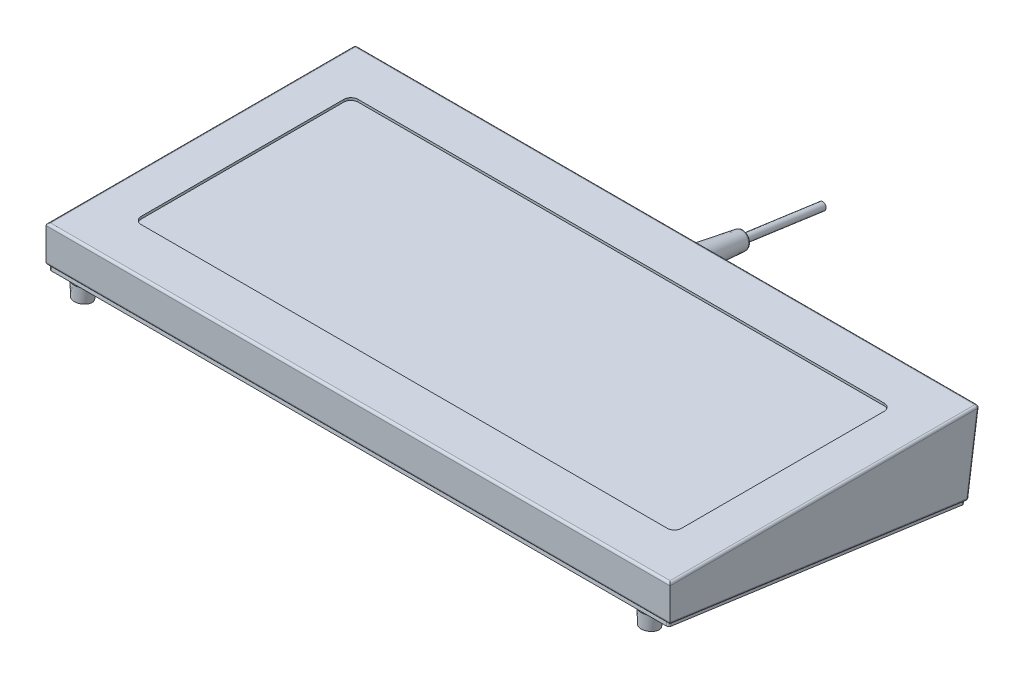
ISO-10303-21;
HEADER;
FILE_DESCRIPTION(('STEP AP214'),'2;1');
FILE_NAME('part.step','',(''),(''),'','','');
FILE_SCHEMA(('AUTOMOTIVE_DESIGN { 1 0 10303 214 1 1 1 1 }'));
ENDSEC;
DATA;
#1=APPLICATION_CONTEXT('core data for automotive mechanical design processes');
#2=APPLICATION_PROTOCOL_DEFINITION('international standard','automotive_design',2000,#1);
#3=PRODUCT_CONTEXT('',#1,'mechanical');
#4=PRODUCT('Part','Part','',(#3));
#5=PRODUCT_RELATED_PRODUCT_CATEGORY('part','',(#4));
#6=PRODUCT_DEFINITION_FORMATION('','',#4);
#7=PRODUCT_DEFINITION_CONTEXT('part definition',#1,'design');
#8=PRODUCT_DEFINITION('design','',#6,#7);
#9=PRODUCT_DEFINITION_SHAPE('','',#8);
#10=(LENGTH_UNIT() NAMED_UNIT(*) SI_UNIT(.MILLI.,.METRE.));
#11=(NAMED_UNIT(*) PLANE_ANGLE_UNIT() SI_UNIT($,.RADIAN.));
#12=(NAMED_UNIT(*) SI_UNIT($,.STERADIAN.) SOLID_ANGLE_UNIT());
#13=UNCERTAINTY_MEASURE_WITH_UNIT(LENGTH_MEASURE(1.E-05),#10,'distance_accuracy_value','');
#14=(GEOMETRIC_REPRESENTATION_CONTEXT(3) GLOBAL_UNCERTAINTY_ASSIGNED_CONTEXT((#13)) GLOBAL_UNIT_ASSIGNED_CONTEXT((#10,
#11,#12)) REPRESENTATION_CONTEXT('',''));
#15=CARTESIAN_POINT('',(0.,0.,0.));
#16=DIRECTION('',(0.,0.,1.));
#17=DIRECTION('',(1.,0.,0.));
#18=AXIS2_PLACEMENT_3D('',#15,#16,#17);
#19=CARTESIAN_POINT('',(208.28,-51.915397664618,7.2962333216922));
#20=DIRECTION('',(0.,0.990409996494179,-0.13815946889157));
#21=DIRECTION('',(0.,0.13815946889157,0.990409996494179));
#22=AXIS2_PLACEMENT_3D('',#19,#20,#21);
#23=PLANE('',#22);
#24=CARTESIAN_POINT('',(-205.232,-51.5646879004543,9.81033140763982));
#25=DIRECTION('',(0.,-0.990409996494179,0.13815946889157));
#26=DIRECTION('',(0.,-0.13815946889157,-0.990409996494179));
#27=AXIS2_PLACEMENT_3D('',#24,#25,#26);
#28=CIRCLE('',#27,1.52400000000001);
#29=CARTESIAN_POINT('',(-206.756,-51.5646879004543,9.81033140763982));
#30=VERTEX_POINT('',#29);
#31=CARTESIAN_POINT('',(-206.367921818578,-51.7050580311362,8.80407406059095));
#32=VERTEX_POINT('',#31);
#33=EDGE_CURVE('E577',#30,#32,#28,.T.);
#34=ORIENTED_EDGE('',*,*,#33,.F.);
#35=DIRECTION('',(0.,-0.13815946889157,-0.990409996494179));
#36=VECTOR('',#35,1.);
#37=CARTESIAN_POINT('',(-206.756,-51.915397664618,7.2962333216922));
#38=LINE('',#37,#36);
#39=CARTESIAN_POINT('',(-206.756,-51.7050580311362,8.80407406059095));
#40=VERTEX_POINT('',#39);
#41=EDGE_CURVE('E413',#30,#40,#38,.T.);
#42=ORIENTED_EDGE('',*,*,#41,.T.);
#43=DIRECTION('',(-1.,0.,0.));
#44=VECTOR('',#43,1.);
#45=CARTESIAN_POINT('',(208.28,-51.7050580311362,8.80407406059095));
#46=LINE('',#45,#44);
#47=EDGE_CURVE('E358',#40,#32,#46,.F.);
#48=ORIENTED_EDGE('',*,*,#47,.T.);
#49=EDGE_LOOP('',(#34,#42,#48));
#50=FACE_BOUND('',#49,.T.);
#51=ADVANCED_FACE('F32',(#50),#23,.F.);
#52=CARTESIAN_POINT('',(205.232,-51.5646879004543,9.81033140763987));
#53=DIRECTION('',(0.,-0.990409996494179,0.13815946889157));
#54=DIRECTION('',(0.,0.13815946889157,0.990409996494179));
#55=AXIS2_PLACEMENT_3D('',#52,#53,#54);
#56=CIRCLE('',#55,1.52400000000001);
#57=CARTESIAN_POINT('',(206.367921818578,-51.7050580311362,8.80407406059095));
#58=VERTEX_POINT('',#57);
#59=CARTESIAN_POINT('',(206.756,-51.5646879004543,9.81033140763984));
#60=VERTEX_POINT('',#59);
#61=EDGE_CURVE('E574',#58,#60,#56,.T.);
#62=ORIENTED_EDGE('',*,*,#61,.F.);
#63=CARTESIAN_POINT('',(206.756,-51.7050580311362,8.80407406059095));
#64=VERTEX_POINT('',#63);
#65=EDGE_CURVE('E409',#58,#64,#46,.F.);
#66=ORIENTED_EDGE('',*,*,#65,.T.);
#67=DIRECTION('',(0.,-0.13815946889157,-0.990409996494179));
#68=VECTOR('',#67,1.);
#69=CARTESIAN_POINT('',(206.756,-24.1045873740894,206.660813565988));
#70=LINE('',#69,#68);
#71=EDGE_CURVE('E418',#64,#60,#70,.F.);
#72=ORIENTED_EDGE('',*,*,#71,.T.);
#73=EDGE_LOOP('',(#62,#66,#72));
#74=FACE_BOUND('',#73,.T.);
#75=ADVANCED_FACE('F656',(#74),#23,.F.);
#76=CARTESIAN_POINT('',(205.232,-24.4300391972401,204.327779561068));
#77=DIRECTION('',(0.,-0.990409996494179,0.13815946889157));
#78=DIRECTION('',(0.,-0.13815946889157,-0.990409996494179));
#79=AXIS2_PLACEMENT_3D('',#76,#77,#78);
#80=CIRCLE('',#79,1.52400000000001);
#81=CARTESIAN_POINT('',(206.756,-24.4300391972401,204.327779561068));
#82=VERTEX_POINT('',#81);
#83=CARTESIAN_POINT('',(206.354480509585,-24.2876200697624,205.34872534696));
#84=VERTEX_POINT('',#83);
#85=EDGE_CURVE('E564',#82,#84,#80,.T.);
#86=ORIENTED_EDGE('',*,*,#85,.F.);
#87=CARTESIAN_POINT('',(206.756,-24.2876200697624,205.34872534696));
#88=VERTEX_POINT('',#87);
#89=EDGE_CURVE('E421',#82,#88,#70,.F.);
#90=ORIENTED_EDGE('',*,*,#89,.T.);
#91=DIRECTION('',(-1.,0.,0.));
#92=VECTOR('',#91,1.);
#93=CARTESIAN_POINT('',(208.28,-24.2876200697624,205.34872534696));
#94=LINE('',#93,#92);
#95=EDGE_CURVE('E414',#88,#84,#94,.T.);
#96=ORIENTED_EDGE('',*,*,#95,.T.);
#97=EDGE_LOOP('',(#86,#90,#96));
#98=FACE_BOUND('',#97,.T.);
#99=ADVANCED_FACE('F669',(#98),#23,.F.);
#100=CARTESIAN_POINT('',(-205.232,-24.4300391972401,204.327779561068));
#101=DIRECTION('',(0.,-0.990409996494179,0.13815946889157));
#102=DIRECTION('',(0.,-0.13815946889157,-0.990409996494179));
#103=AXIS2_PLACEMENT_3D('',#100,#101,#102);
#104=CIRCLE('',#103,1.52400000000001);
#105=CARTESIAN_POINT('',(-206.354480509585,-24.2876200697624,205.34872534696));
#106=VERTEX_POINT('',#105);
#107=CARTESIAN_POINT('',(-206.756,-24.4300391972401,204.327779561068));
#108=VERTEX_POINT('',#107);
#109=EDGE_CURVE('E561',#106,#108,#104,.T.);
#110=ORIENTED_EDGE('',*,*,#109,.F.);
#111=CARTESIAN_POINT('',(-206.756,-24.2876200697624,205.34872534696));
#112=VERTEX_POINT('',#111);
#113=EDGE_CURVE('E417',#106,#112,#94,.T.);
#114=ORIENTED_EDGE('',*,*,#113,.T.);
#115=EDGE_CURVE('E410',#112,#108,#38,.T.);
#116=ORIENTED_EDGE('',*,*,#115,.T.);
#117=EDGE_LOOP('',(#110,#114,#116));
#118=FACE_BOUND('',#117,.T.);
#119=ADVANCED_FACE('F631',(#118),#23,.F.);
#120=CARTESIAN_POINT('',(208.28,0.,0.));
#121=DIRECTION('',(0.,-1.,0.));
#122=DIRECTION('',(0.,0.,-1.));
#123=AXIS2_PLACEMENT_3D('',#120,#121,#122);
#124=PLANE('',#123);
#125=DIRECTION('',(1.,0.,0.));
#126=VECTOR('',#125,1.);
#127=CARTESIAN_POINT('',(-175.5648,0.,175.846542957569));
#128=LINE('',#127,#126);
#129=CARTESIAN_POINT('',(-175.5648,0.,175.846542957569));
#130=VERTEX_POINT('',#129);
#131=CARTESIAN_POINT('',(175.5648,0.,175.846542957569));
#132=VERTEX_POINT('',#131);
#133=EDGE_CURVE('E504',#130,#132,#128,.T.);
#134=ORIENTED_EDGE('',*,*,#133,.F.);
#135=CARTESIAN_POINT('',(-175.5648,0.,171.071342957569));
#136=DIRECTION('',(0.,1.,0.));
#137=DIRECTION('',(0.,0.,1.));
#138=AXIS2_PLACEMENT_3D('',#135,#136,#137);
#139=CIRCLE('',#138,4.77520000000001);
#140=CARTESIAN_POINT('',(-180.34,0.,171.071342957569));
#141=VERTEX_POINT('',#140);
#142=EDGE_CURVE('E507',#141,#130,#139,.T.);
#143=ORIENTED_EDGE('',*,*,#142,.F.);
#144=DIRECTION('',(0.,0.,1.));
#145=VECTOR('',#144,1.);
#146=CARTESIAN_POINT('',(-180.34,0.,35.8417429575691));
#147=LINE('',#146,#145);
#148=CARTESIAN_POINT('',(-180.34,0.,35.8417429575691));
#149=VERTEX_POINT('',#148);
#150=EDGE_CURVE('E485',#149,#141,#147,.T.);
#151=ORIENTED_EDGE('',*,*,#150,.F.);
#152=CARTESIAN_POINT('',(-175.5648,0.,35.8417429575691));
#153=DIRECTION('',(0.,1.,0.));
#154=DIRECTION('',(0.,0.,1.));
#155=AXIS2_PLACEMENT_3D('',#152,#153,#154);
#156=CIRCLE('',#155,4.77520000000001);
#157=CARTESIAN_POINT('',(-175.5648,0.,31.0665429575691));
#158=VERTEX_POINT('',#157);
#159=EDGE_CURVE('E489',#158,#149,#156,.T.);
#160=ORIENTED_EDGE('',*,*,#159,.F.);
#161=DIRECTION('',(-1.,0.,0.));
#162=VECTOR('',#161,1.);
#163=CARTESIAN_POINT('',(-175.5648,0.,31.0665429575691));
#164=LINE('',#163,#162);
#165=CARTESIAN_POINT('',(175.5648,0.,31.0665429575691));
#166=VERTEX_POINT('',#165);
#167=EDGE_CURVE('E492',#166,#158,#164,.T.);
#168=ORIENTED_EDGE('',*,*,#167,.F.);
#169=CARTESIAN_POINT('',(175.5648,0.,35.8417429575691));
#170=DIRECTION('',(0.,1.,0.));
#171=DIRECTION('',(0.,0.,-1.));
#172=AXIS2_PLACEMENT_3D('',#169,#170,#171);
#173=CIRCLE('',#172,4.77520000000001);
#174=CARTESIAN_POINT('',(180.34,0.,35.8417429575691));
#175=VERTEX_POINT('',#174);
#176=EDGE_CURVE('E495',#175,#166,#173,.T.);
#177=ORIENTED_EDGE('',*,*,#176,.F.);
#178=DIRECTION('',(0.,0.,-1.));
#179=VECTOR('',#178,1.);
#180=CARTESIAN_POINT('',(180.34,0.,35.8417429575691));
#181=LINE('',#180,#179);
#182=CARTESIAN_POINT('',(180.34,0.,171.071342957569));
#183=VERTEX_POINT('',#182);
#184=EDGE_CURVE('E498',#183,#175,#181,.T.);
#185=ORIENTED_EDGE('',*,*,#184,.F.);
#186=CARTESIAN_POINT('',(175.5648,0.,171.071342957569));
#187=DIRECTION('',(0.,1.,0.));
#188=DIRECTION('',(0.,0.,1.));
#189=AXIS2_PLACEMENT_3D('',#186,#187,#188);
#190=CIRCLE('',#189,4.77520000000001);
#191=EDGE_CURVE('E501',#132,#183,#190,.T.);
#192=ORIENTED_EDGE('',*,*,#191,.F.);
#193=EDGE_LOOP('',(#134,#143,#151,#160,#168,#177,#185,#192));
#194=FACE_BOUND('',#193,.T.);
#195=DIRECTION('',(0.,0.,1.));
#196=VECTOR('',#195,1.);
#197=CARTESIAN_POINT('',(206.756,0.,0.));
#198=LINE('',#197,#196);
#199=CARTESIAN_POINT('',(206.756,0.,205.159924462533));
#200=VERTEX_POINT('',#199);
#201=CARTESIAN_POINT('',(206.756,0.,1.75316145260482));
#202=VERTEX_POINT('',#201);
#203=EDGE_CURVE('E455',#200,#202,#198,.F.);
#204=ORIENTED_EDGE('',*,*,#203,.T.);
#205=DIRECTION('',(-1.,0.,0.));
#206=VECTOR('',#205,1.);
#207=CARTESIAN_POINT('',(208.28,0.,1.75316145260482));
#208=LINE('',#207,#206);
#209=CARTESIAN_POINT('',(-206.756,0.,1.75316145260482));
#210=VERTEX_POINT('',#209);
#211=EDGE_CURVE('E452',#202,#210,#208,.T.);
#212=ORIENTED_EDGE('',*,*,#211,.T.);
#213=DIRECTION('',(0.,0.,1.));
#214=VECTOR('',#213,1.);
#215=CARTESIAN_POINT('',(-206.756,0.,0.));
#216=LINE('',#215,#214);
#217=CARTESIAN_POINT('',(-206.756,0.,205.159924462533));
#218=VERTEX_POINT('',#217);
#219=EDGE_CURVE('E459',#210,#218,#216,.T.);
#220=ORIENTED_EDGE('',*,*,#219,.T.);
#221=DIRECTION('',(-1.,0.,0.));
#222=VECTOR('',#221,1.);
#223=CARTESIAN_POINT('',(208.28,0.,205.159924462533));
#224=LINE('',#223,#222);
#225=EDGE_CURVE('E457',#218,#200,#224,.F.);
#226=ORIENTED_EDGE('',*,*,#225,.T.);
#227=EDGE_LOOP('',(#204,#212,#220,#226));
#228=FACE_BOUND('',#227,.T.);
#229=ADVANCED_FACE('F736',(#194,#228),#124,.F.);
#230=CARTESIAN_POINT('',(208.28,0.,206.685485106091));
#231=DIRECTION('',(0.,0.00102351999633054,-0.999999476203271));
#232=DIRECTION('',(0.,0.999999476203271,0.00102351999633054));
#233=AXIS2_PLACEMENT_3D('',#230,#231,#232);
#234=PLANE('',#233);
#235=DIRECTION('',(0.,-0.999999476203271,-0.00102351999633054));
#236=VECTOR('',#235,1.);
#237=CARTESIAN_POINT('',(208.28,0.,206.685485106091));
#238=LINE('',#237,#236);
#239=CARTESIAN_POINT('',(208.28,-1.52555984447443,206.683923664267));
#240=VERTEX_POINT('',#239);
#241=CARTESIAN_POINT('',(208.28,-22.5656109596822,206.662388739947));
#242=VERTEX_POINT('',#241);
#243=EDGE_CURVE('E465',#240,#242,#238,.T.);
#244=ORIENTED_EDGE('',*,*,#243,.F.);
#245=DIRECTION('',(-1.,0.,0.));
#246=VECTOR('',#245,1.);
#247=CARTESIAN_POINT('',(208.28,-1.52555984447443,206.683923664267));
#248=LINE('',#247,#246);
#249=CARTESIAN_POINT('',(-208.28,-1.52555984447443,206.683923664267));
#250=VERTEX_POINT('',#249);
#251=EDGE_CURVE('E428',#240,#250,#248,.T.);
#252=ORIENTED_EDGE('',*,*,#251,.T.);
#253=DIRECTION('',(0.,-0.999999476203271,-0.00102351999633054));
#254=VECTOR('',#253,1.);
#255=CARTESIAN_POINT('',(-208.28,0.,206.685485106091));
#256=LINE('',#255,#254);
#257=CARTESIAN_POINT('',(-208.28,-22.5656109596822,206.662388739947));
#258=VERTEX_POINT('',#257);
#259=EDGE_CURVE('E362',#250,#258,#256,.T.);
#260=ORIENTED_EDGE('',*,*,#259,.T.);
#261=CARTESIAN_POINT('',(-206.756,-22.5656109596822,206.662388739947));
#262=DIRECTION('',(0.,0.00102351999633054,-0.999999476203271));
#263=DIRECTION('',(0.,-0.999999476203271,-0.00102351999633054));
#264=AXIS2_PLACEMENT_3D('',#261,#262,#263);
#265=ELLIPSE('',#264,1.53897722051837,1.524);
#266=CARTESIAN_POINT('',(-208.265168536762,-22.7797950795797,206.662169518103));
#267=VERTEX_POINT('',#266);
#268=EDGE_CURVE('E430',#258,#267,#265,.F.);
#269=ORIENTED_EDGE('',*,*,#268,.T.);
#270=DIRECTION('',(-1.,0.,0.));
#271=VECTOR('',#270,1.);
#272=CARTESIAN_POINT('',(208.28,-22.7797950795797,206.662169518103));
#273=LINE('',#272,#271);
#274=CARTESIAN_POINT('',(208.265168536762,-22.7797950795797,206.662169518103));
#275=VERTEX_POINT('',#274);
#276=EDGE_CURVE('E432',#267,#275,#273,.F.);
#277=ORIENTED_EDGE('',*,*,#276,.T.);
#278=CARTESIAN_POINT('',(206.756,-22.5656109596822,206.662388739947));
#279=DIRECTION('',(0.,0.00102351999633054,-0.999999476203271));
#280=DIRECTION('',(0.,0.999999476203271,0.00102351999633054));
#281=AXIS2_PLACEMENT_3D('',#278,#279,#280);
#282=ELLIPSE('',#281,1.53897722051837,1.524);
#283=EDGE_CURVE('E434',#275,#242,#282,.F.);
#284=ORIENTED_EDGE('',*,*,#283,.T.);
#285=EDGE_LOOP('',(#244,#252,#260,#269,#277,#284));
#286=FACE_BOUND('',#285,.T.);
#287=ADVANCED_FACE('F671',(#286),#234,.F.);
#288=CARTESIAN_POINT('',(208.28,-51.915397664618,7.2962333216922));
#289=DIRECTION('',(0.,0.139173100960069,0.99026806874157));
#290=DIRECTION('',(0.,-0.99026806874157,0.139173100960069));
#291=AXIS2_PLACEMENT_3D('',#288,#289,#290);
#292=PLANE('',#291);
#293=CARTESIAN_POINT('',(0.,-26.0719364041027,3.66417170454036));
#294=DIRECTION('',(0.,0.139173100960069,0.99026806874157));
#295=DIRECTION('',(0.,-0.99026806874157,0.139173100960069));
#296=AXIS2_PLACEMENT_3D('',#293,#294,#295);
#297=CIRCLE('',#296,8.382);
#298=CARTESIAN_POINT('',(0.,-34.3723633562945,4.83072063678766));
#299=VERTEX_POINT('',#298);
#300=EDGE_CURVE('E256',#299,#299,#297,.F.);
#301=ORIENTED_EDGE('',*,*,#300,.F.);
#302=EDGE_LOOP('',(#301));
#303=FACE_BOUND('',#302,.T.);
#304=DIRECTION('',(-1.,0.,0.));
#305=VECTOR('',#304,1.);
#306=CARTESIAN_POINT('',(208.28,-50.4077730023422,7.08435049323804));
#307=LINE('',#306,#305);
#308=CARTESIAN_POINT('',(206.756,-50.4077730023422,7.08435049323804));
#309=VERTEX_POINT('',#308);
#310=CARTESIAN_POINT('',(-206.756,-50.4077730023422,7.08435049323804));
#311=VERTEX_POINT('',#310);
#312=EDGE_CURVE('E448',#309,#311,#307,.T.);
#313=ORIENTED_EDGE('',*,*,#312,.T.);
#314=DIRECTION('',(0.,0.99026806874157,-0.139173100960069));
#315=VECTOR('',#314,1.);
#316=CARTESIAN_POINT('',(-206.756,-51.915397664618,7.2962333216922));
#317=LINE('',#316,#315);
#318=CARTESIAN_POINT('',(-206.756,-1.73609980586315,0.243992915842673));
#319=VERTEX_POINT('',#318);
#320=EDGE_CURVE('E443',#311,#319,#317,.T.);
#321=ORIENTED_EDGE('',*,*,#320,.T.);
#322=DIRECTION('',(-1.,0.,0.));
#323=VECTOR('',#322,1.);
#324=CARTESIAN_POINT('',(208.28,-1.73609980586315,0.243992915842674));
#325=LINE('',#324,#323);
#326=CARTESIAN_POINT('',(206.756,-1.73609980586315,0.243992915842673));
#327=VERTEX_POINT('',#326);
#328=EDGE_CURVE('E445',#319,#327,#325,.F.);
#329=ORIENTED_EDGE('',*,*,#328,.T.);
#330=DIRECTION('',(0.,0.99026806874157,-0.139173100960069));
#331=VECTOR('',#330,1.);
#332=CARTESIAN_POINT('',(206.756,-51.915397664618,7.2962333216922));
#333=LINE('',#332,#331);
#334=EDGE_CURVE('E450',#327,#309,#333,.F.);
#335=ORIENTED_EDGE('',*,*,#334,.T.);
#336=EDGE_LOOP('',(#313,#321,#329,#335));
#337=FACE_BOUND('',#336,.T.);
#338=ADVANCED_FACE('F696',(#303,#337),#292,.F.);
#339=CARTESIAN_POINT('',(208.28,0.,0.));
#340=DIRECTION('',(1.,0.,0.));
#341=DIRECTION('',(0.,0.,-1.));
#342=AXIS2_PLACEMENT_3D('',#339,#340,#341);
#343=PLANE('',#342);
#344=DIRECTION('',(0.,0.99026806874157,-0.139173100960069));
#345=VECTOR('',#344,1.);
#346=CARTESIAN_POINT('',(208.28,0.212099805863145,1.50916853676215));
#347=LINE('',#346,#345);
#348=CARTESIAN_POINT('',(208.28,-50.1956731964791,8.59351903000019));
#349=VERTEX_POINT('',#348);
#350=CARTESIAN_POINT('',(208.28,-1.524,1.75316145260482));
#351=VERTEX_POINT('',#350);
#352=EDGE_CURVE('E439',#349,#351,#347,.T.);
#353=ORIENTED_EDGE('',*,*,#352,.T.);
#354=DIRECTION('',(0.,0.,1.));
#355=VECTOR('',#354,1.);
#356=CARTESIAN_POINT('',(208.28,-1.52400000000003,206.685485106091));
#357=LINE('',#356,#355);
#358=CARTESIAN_POINT('',(208.28,-1.52400000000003,206.6839252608));
#359=VERTEX_POINT('',#358);
#360=EDGE_CURVE('E436',#351,#359,#357,.T.);
#361=ORIENTED_EDGE('',*,*,#360,.T.);
#362=EDGE_CURVE('E461',#359,#240,#238,.T.);
#363=ORIENTED_EDGE('',*,*,#362,.T.);
#364=ORIENTED_EDGE('',*,*,#243,.T.);
#365=DIRECTION('',(0.,-0.13815946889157,-0.990409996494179));
#366=VECTOR('',#365,1.);
#367=CARTESIAN_POINT('',(208.28,-50.4060128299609,7.08567829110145));
#368=LINE('',#367,#366);
#369=EDGE_CURVE('E441',#242,#349,#368,.T.);
#370=ORIENTED_EDGE('',*,*,#369,.T.);
#371=EDGE_LOOP('',(#353,#361,#363,#364,#370));
#372=FACE_BOUND('',#371,.T.);
#373=ADVANCED_FACE('F674',(#372),#343,.T.);
#374=CARTESIAN_POINT('',(-208.28,0.,0.));
#375=DIRECTION('',(1.,0.,0.));
#376=DIRECTION('',(0.,0.,-1.));
#377=AXIS2_PLACEMENT_3D('',#374,#375,#376);
#378=PLANE('',#377);
#379=CARTESIAN_POINT('',(-208.28,-1.52400000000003,206.6839252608));
#380=VERTEX_POINT('',#379);
#381=EDGE_CURVE('E464',#380,#250,#256,.T.);
#382=ORIENTED_EDGE('',*,*,#381,.F.);
#383=DIRECTION('',(0.,0.,1.));
#384=VECTOR('',#383,1.);
#385=CARTESIAN_POINT('',(-208.28,-1.524,0.));
#386=LINE('',#385,#384);
#387=CARTESIAN_POINT('',(-208.28,-1.524,1.75316145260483));
#388=VERTEX_POINT('',#387);
#389=EDGE_CURVE('E422',#380,#388,#386,.F.);
#390=ORIENTED_EDGE('',*,*,#389,.T.);
#391=DIRECTION('',(0.,0.99026806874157,-0.139173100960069));
#392=VECTOR('',#391,1.);
#393=CARTESIAN_POINT('',(-208.28,0.212099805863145,1.50916853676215));
#394=LINE('',#393,#392);
#395=CARTESIAN_POINT('',(-208.28,-50.1956731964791,8.5935190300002));
#396=VERTEX_POINT('',#395);
#397=EDGE_CURVE('E424',#388,#396,#394,.F.);
#398=ORIENTED_EDGE('',*,*,#397,.T.);
#399=DIRECTION('',(0.,-0.13815946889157,-0.990409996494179));
#400=VECTOR('',#399,1.);
#401=CARTESIAN_POINT('',(-208.28,-50.4134262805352,7.03253422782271));
#402=LINE('',#401,#400);
#403=EDGE_CURVE('E426',#396,#258,#402,.F.);
#404=ORIENTED_EDGE('',*,*,#403,.T.);
#405=ORIENTED_EDGE('',*,*,#259,.F.);
#406=EDGE_LOOP('',(#382,#390,#398,#404,#405));
#407=FACE_BOUND('',#406,.T.);
#408=ADVANCED_FACE('F685',(#407),#378,.F.);
#409=CARTESIAN_POINT('',(208.28,-22.7782352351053,205.138170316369));
#410=DIRECTION('',(-1.,0.,0.));
#411=DIRECTION('',(0.,0.,1.));
#412=AXIS2_PLACEMENT_3D('',#409,#410,#411);
#413=CYLINDRICAL_SURFACE('',#412,1.524);
#414=CARTESIAN_POINT('',(-206.756,-22.7782352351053,205.138170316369));
#415=DIRECTION('',(-0.707106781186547,-0.0976934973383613,-0.700325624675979));
#416=DIRECTION('',(-0.707106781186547,0.0976934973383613,0.700325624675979));
#417=AXIS2_PLACEMENT_3D('',#414,#415,#416);
#418=ELLIPSE('',#417,2.1552614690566,1.524);
#419=EDGE_CURVE('E363',#112,#267,#418,.T.);
#420=ORIENTED_EDGE('',*,*,#419,.F.);
#421=ORIENTED_EDGE('',*,*,#113,.F.);
#422=DIRECTION('',(-1.,0.,0.));
#423=VECTOR('',#422,1.);
#424=CARTESIAN_POINT('',(208.28,-24.2876200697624,205.34872534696));
#425=LINE('',#424,#423);
#426=EDGE_CURVE('E509',#106,#84,#425,.F.);
#427=ORIENTED_EDGE('',*,*,#426,.T.);
#428=ORIENTED_EDGE('',*,*,#95,.F.);
#429=CARTESIAN_POINT('',(206.756,-22.7782352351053,205.138170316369));
#430=DIRECTION('',(-0.707106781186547,0.0976934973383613,0.700325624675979));
#431=DIRECTION('',(0.707106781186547,0.0976934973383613,0.700325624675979));
#432=AXIS2_PLACEMENT_3D('',#429,#430,#431);
#433=ELLIPSE('',#432,2.1552614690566,1.524);
#434=EDGE_CURVE('E359',#275,#88,#433,.F.);
#435=ORIENTED_EDGE('',*,*,#434,.F.);
#436=ORIENTED_EDGE('',*,*,#276,.F.);
#437=EDGE_LOOP('',(#420,#421,#427,#428,#435,#436));
#438=FACE_BOUND('',#437,.T.);
#439=ADVANCED_FACE('F635',(#438),#413,.T.);
#440=CARTESIAN_POINT('',(206.756,-50.4134262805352,7.03253422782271));
#441=DIRECTION('',(0.,0.13815946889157,0.990409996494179));
#442=DIRECTION('',(0.,-0.990409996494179,0.13815946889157));
#443=AXIS2_PLACEMENT_3D('',#440,#441,#442);
#444=CYLINDRICAL_SURFACE('',#443,1.524);
#445=ORIENTED_EDGE('',*,*,#434,.T.);
#446=ORIENTED_EDGE('',*,*,#89,.F.);
#447=DIRECTION('',(0.,0.13815946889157,0.990409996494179));
#448=VECTOR('',#447,1.);
#449=CARTESIAN_POINT('',(206.756,-24.4300391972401,204.327779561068));
#450=LINE('',#449,#448);
#451=EDGE_CURVE('E568',#60,#82,#450,.T.);
#452=ORIENTED_EDGE('',*,*,#451,.F.);
#453=ORIENTED_EDGE('',*,*,#71,.F.);
#454=CARTESIAN_POINT('',(206.756,-50.1956731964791,8.59351903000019));
#455=DIRECTION('',(0.,-0.138159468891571,-0.990409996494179));
#456=DIRECTION('',(0.,0.990409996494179,-0.138159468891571));
#457=AXIS2_PLACEMENT_3D('',#454,#455,#456);
#458=CIRCLE('',#457,1.524);
#459=EDGE_CURVE('E369',#349,#64,#458,.T.);
#460=ORIENTED_EDGE('',*,*,#459,.F.);
#461=ORIENTED_EDGE('',*,*,#369,.F.);
#462=ORIENTED_EDGE('',*,*,#283,.F.);
#463=EDGE_LOOP('',(#445,#446,#452,#453,#460,#461,#462));
#464=FACE_BOUND('',#463,.T.);
#465=ADVANCED_FACE('F665',(#464),#444,.T.);
#466=CARTESIAN_POINT('',(-206.756,-50.4060128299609,7.08567829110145));
#467=DIRECTION('',(0.,-0.13815946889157,-0.990409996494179));
#468=DIRECTION('',(0.,0.990409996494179,-0.13815946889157));
#469=AXIS2_PLACEMENT_3D('',#466,#467,#468);
#470=CYLINDRICAL_SURFACE('',#469,1.524);
#471=ORIENTED_EDGE('',*,*,#268,.F.);
#472=ORIENTED_EDGE('',*,*,#403,.F.);
#473=CARTESIAN_POINT('',(-206.756,-50.1956731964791,8.5935190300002));
#474=DIRECTION('',(0.,-0.13815946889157,-0.990409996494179));
#475=DIRECTION('',(0.,0.990409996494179,-0.13815946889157));
#476=AXIS2_PLACEMENT_3D('',#473,#474,#475);
#477=CIRCLE('',#476,1.524);
#478=EDGE_CURVE('E372',#40,#396,#477,.T.);
#479=ORIENTED_EDGE('',*,*,#478,.F.);
#480=ORIENTED_EDGE('',*,*,#41,.F.);
#481=DIRECTION('',(0.,-0.13815946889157,-0.990409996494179));
#482=VECTOR('',#481,1.);
#483=CARTESIAN_POINT('',(-206.756,-51.5646879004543,9.81033140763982));
#484=LINE('',#483,#482);
#485=EDGE_CURVE('E303',#108,#30,#484,.T.);
#486=ORIENTED_EDGE('',*,*,#485,.F.);
#487=ORIENTED_EDGE('',*,*,#115,.F.);
#488=ORIENTED_EDGE('',*,*,#419,.T.);
#489=EDGE_LOOP('',(#471,#472,#479,#480,#486,#487,#488));
#490=FACE_BOUND('',#489,.T.);
#491=ADVANCED_FACE('F641',(#490),#470,.T.);
#492=CARTESIAN_POINT('',(208.28,-50.1956731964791,8.5935190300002));
#493=DIRECTION('',(-1.,0.,0.));
#494=DIRECTION('',(0.,0.,1.));
#495=AXIS2_PLACEMENT_3D('',#492,#493,#494);
#496=CYLINDRICAL_SURFACE('',#495,1.524);
#497=CARTESIAN_POINT('',(206.756,-50.1956731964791,8.5935190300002));
#498=DIRECTION('',(1.,0.,0.));
#499=DIRECTION('',(0.,0.,-1.));
#500=AXIS2_PLACEMENT_3D('',#497,#498,#499);
#501=CIRCLE('',#500,1.524);
#502=EDGE_CURVE('E366',#64,#309,#501,.T.);
#503=ORIENTED_EDGE('',*,*,#502,.F.);
#504=ORIENTED_EDGE('',*,*,#65,.F.);
#505=EDGE_CURVE('E408',#32,#58,#46,.F.);
#506=ORIENTED_EDGE('',*,*,#505,.F.);
#507=ORIENTED_EDGE('',*,*,#47,.F.);
#508=CARTESIAN_POINT('',(-206.756,-50.1956731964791,8.5935190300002));
#509=DIRECTION('',(-1.,0.,0.));
#510=DIRECTION('',(0.,0.,1.));
#511=AXIS2_PLACEMENT_3D('',#508,#509,#510);
#512=CIRCLE('',#511,1.524);
#513=EDGE_CURVE('E375',#311,#40,#512,.T.);
#514=ORIENTED_EDGE('',*,*,#513,.F.);
#515=ORIENTED_EDGE('',*,*,#312,.F.);
#516=EDGE_LOOP('',(#503,#504,#506,#507,#514,#515));
#517=FACE_BOUND('',#516,.T.);
#518=ADVANCED_FACE('F650',(#517),#496,.T.);
#519=CARTESIAN_POINT('',(206.756,-50.1956731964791,8.5935190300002));
#520=DIRECTION('',(0.,0.,1.));
#521=DIRECTION('',(1.,0.,0.));
#522=AXIS2_PLACEMENT_3D('',#519,#520,#521);
#523=SPHERICAL_SURFACE('',#522,1.524);
#524=ORIENTED_EDGE('',*,*,#459,.T.);
#525=ORIENTED_EDGE('',*,*,#502,.T.);
#526=CARTESIAN_POINT('',(206.756,-50.1956731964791,8.5935190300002));
#527=DIRECTION('',(0.,-0.99026806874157,0.13917310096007));
#528=DIRECTION('',(0.,-0.13917310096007,-0.99026806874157));
#529=AXIS2_PLACEMENT_3D('',#526,#527,#528);
#530=CIRCLE('',#529,1.524);
#531=EDGE_CURVE('E378',#349,#309,#530,.F.);
#532=ORIENTED_EDGE('',*,*,#531,.F.);
#533=EDGE_LOOP('',(#524,#525,#532));
#534=FACE_BOUND('',#533,.T.);
#535=ADVANCED_FACE('F661',(#534),#523,.T.);
#536=CARTESIAN_POINT('',(208.28,-1.52400000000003,205.159924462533));
#537=DIRECTION('',(-1.,0.,0.));
#538=DIRECTION('',(0.,0.,1.));
#539=AXIS2_PLACEMENT_3D('',#536,#537,#538);
#540=CYLINDRICAL_SURFACE('',#539,1.524);
#541=ORIENTED_EDGE('',*,*,#251,.F.);
#542=ORIENTED_EDGE('',*,*,#362,.F.);
#543=CARTESIAN_POINT('',(206.756,-1.52400000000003,205.159924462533));
#544=DIRECTION('',(-0.707106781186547,0.,0.707106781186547));
#545=DIRECTION('',(-0.707106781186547,0.,-0.707106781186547));
#546=AXIS2_PLACEMENT_3D('',#543,#544,#545);
#547=ELLIPSE('',#546,2.1552614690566,1.524);
#548=EDGE_CURVE('E381',#200,#359,#547,.F.);
#549=ORIENTED_EDGE('',*,*,#548,.F.);
#550=ORIENTED_EDGE('',*,*,#225,.F.);
#551=CARTESIAN_POINT('',(-206.756,-1.52400000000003,205.159924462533));
#552=DIRECTION('',(0.707106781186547,0.,0.707106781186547));
#553=DIRECTION('',(-0.707106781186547,0.,0.707106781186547));
#554=AXIS2_PLACEMENT_3D('',#551,#552,#553);
#555=ELLIPSE('',#554,2.1552614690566,1.524);
#556=EDGE_CURVE('E383',#380,#218,#555,.F.);
#557=ORIENTED_EDGE('',*,*,#556,.F.);
#558=ORIENTED_EDGE('',*,*,#381,.T.);
#559=EDGE_LOOP('',(#541,#542,#549,#550,#557,#558));
#560=FACE_BOUND('',#559,.T.);
#561=ADVANCED_FACE('F681',(#560),#540,.T.);
#562=CARTESIAN_POINT('',(-206.756,-50.1956731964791,8.5935190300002));
#563=DIRECTION('',(0.,0.,1.));
#564=DIRECTION('',(1.,0.,0.));
#565=AXIS2_PLACEMENT_3D('',#562,#563,#564);
#566=SPHERICAL_SURFACE('',#565,1.524);
#567=ORIENTED_EDGE('',*,*,#513,.T.);
#568=ORIENTED_EDGE('',*,*,#478,.T.);
#569=CARTESIAN_POINT('',(-206.756,-50.1956731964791,8.5935190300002));
#570=DIRECTION('',(0.,-0.99026806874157,0.13917310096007));
#571=DIRECTION('',(0.,-0.13917310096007,-0.99026806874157));
#572=AXIS2_PLACEMENT_3D('',#569,#570,#571);
#573=CIRCLE('',#572,1.524);
#574=EDGE_CURVE('E386',#311,#396,#573,.F.);
#575=ORIENTED_EDGE('',*,*,#574,.F.);
#576=EDGE_LOOP('',(#567,#568,#575));
#577=FACE_BOUND('',#576,.T.);
#578=ADVANCED_FACE('F688',(#577),#566,.T.);
#579=CARTESIAN_POINT('',(206.756,0.212099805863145,1.50916853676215));
#580=DIRECTION('',(0.,-0.99026806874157,0.139173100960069));
#581=DIRECTION('',(0.,-0.139173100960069,-0.99026806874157));
#582=AXIS2_PLACEMENT_3D('',#579,#580,#581);
#583=CYLINDRICAL_SURFACE('',#582,1.524);
#584=ORIENTED_EDGE('',*,*,#531,.T.);
#585=ORIENTED_EDGE('',*,*,#334,.F.);
#586=CARTESIAN_POINT('',(206.756,-1.524,1.75316145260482));
#587=DIRECTION('',(0.,0.99026806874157,-0.139173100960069));
#588=DIRECTION('',(0.,0.139173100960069,0.99026806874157));
#589=AXIS2_PLACEMENT_3D('',#586,#587,#588);
#590=CIRCLE('',#589,1.524);
#591=EDGE_CURVE('E389',#351,#327,#590,.T.);
#592=ORIENTED_EDGE('',*,*,#591,.F.);
#593=ORIENTED_EDGE('',*,*,#352,.F.);
#594=EDGE_LOOP('',(#584,#585,#592,#593));
#595=FACE_BOUND('',#594,.T.);
#596=ADVANCED_FACE('F700',(#595),#583,.T.);
#597=CARTESIAN_POINT('',(206.756,-1.524,0.));
#598=DIRECTION('',(0.,0.,-1.));
#599=DIRECTION('',(0.,1.,0.));
#600=AXIS2_PLACEMENT_3D('',#597,#598,#599);
#601=CYLINDRICAL_SURFACE('',#600,1.524);
#602=ORIENTED_EDGE('',*,*,#548,.T.);
#603=ORIENTED_EDGE('',*,*,#360,.F.);
#604=CARTESIAN_POINT('',(206.756,-1.524,1.75316145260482));
#605=DIRECTION('',(0.,0.,-1.));
#606=DIRECTION('',(-1.,0.,0.));
#607=AXIS2_PLACEMENT_3D('',#604,#605,#606);
#608=CIRCLE('',#607,1.524);
#609=EDGE_CURVE('E392',#202,#351,#608,.T.);
#610=ORIENTED_EDGE('',*,*,#609,.F.);
#611=ORIENTED_EDGE('',*,*,#203,.F.);
#612=EDGE_LOOP('',(#602,#603,#610,#611));
#613=FACE_BOUND('',#612,.T.);
#614=ADVANCED_FACE('F703',(#613),#601,.T.);
#615=CARTESIAN_POINT('',(-206.756,-1.524,0.));
#616=DIRECTION('',(0.,0.,1.));
#617=DIRECTION('',(0.,-1.,0.));
#618=AXIS2_PLACEMENT_3D('',#615,#616,#617);
#619=CYLINDRICAL_SURFACE('',#618,1.524);
#620=ORIENTED_EDGE('',*,*,#556,.T.);
#621=ORIENTED_EDGE('',*,*,#219,.F.);
#622=CARTESIAN_POINT('',(-206.756,-1.524,1.75316145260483));
#623=DIRECTION('',(0.,0.,-1.));
#624=DIRECTION('',(0.,1.,0.));
#625=AXIS2_PLACEMENT_3D('',#622,#623,#624);
#626=CIRCLE('',#625,1.524);
#627=EDGE_CURVE('E395',#388,#210,#626,.T.);
#628=ORIENTED_EDGE('',*,*,#627,.F.);
#629=ORIENTED_EDGE('',*,*,#389,.F.);
#630=EDGE_LOOP('',(#620,#621,#628,#629));
#631=FACE_BOUND('',#630,.T.);
#632=ADVANCED_FACE('F711',(#631),#619,.T.);
#633=CARTESIAN_POINT('',(-206.756,-51.7032978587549,8.80540185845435));
#634=DIRECTION('',(0.,0.99026806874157,-0.139173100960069));
#635=DIRECTION('',(0.,0.139173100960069,0.99026806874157));
#636=AXIS2_PLACEMENT_3D('',#633,#634,#635);
#637=CYLINDRICAL_SURFACE('',#636,1.524);
#638=ORIENTED_EDGE('',*,*,#574,.T.);
#639=ORIENTED_EDGE('',*,*,#397,.F.);
#640=CARTESIAN_POINT('',(-206.756,-1.524,1.75316145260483));
#641=DIRECTION('',(0.,0.99026806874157,-0.139173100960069));
#642=DIRECTION('',(0.,0.139173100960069,0.99026806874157));
#643=AXIS2_PLACEMENT_3D('',#640,#641,#642);
#644=CIRCLE('',#643,1.524);
#645=EDGE_CURVE('E398',#319,#388,#644,.T.);
#646=ORIENTED_EDGE('',*,*,#645,.F.);
#647=ORIENTED_EDGE('',*,*,#320,.F.);
#648=EDGE_LOOP('',(#638,#639,#646,#647));
#649=FACE_BOUND('',#648,.T.);
#650=ADVANCED_FACE('F691',(#649),#637,.T.);
#651=CARTESIAN_POINT('',(206.756,-1.524,1.75316145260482));
#652=DIRECTION('',(0.,0.,1.));
#653=DIRECTION('',(1.,0.,0.));
#654=AXIS2_PLACEMENT_3D('',#651,#652,#653);
#655=SPHERICAL_SURFACE('',#654,1.524);
#656=ORIENTED_EDGE('',*,*,#609,.T.);
#657=ORIENTED_EDGE('',*,*,#591,.T.);
#658=CARTESIAN_POINT('',(206.756,-1.524,1.75316145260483));
#659=DIRECTION('',(1.,0.,0.));
#660=DIRECTION('',(0.,0.,-1.));
#661=AXIS2_PLACEMENT_3D('',#658,#659,#660);
#662=CIRCLE('',#661,1.524);
#663=EDGE_CURVE('E401',#202,#327,#662,.F.);
#664=ORIENTED_EDGE('',*,*,#663,.F.);
#665=EDGE_LOOP('',(#656,#657,#664));
#666=FACE_BOUND('',#665,.T.);
#667=ADVANCED_FACE('F719',(#666),#655,.T.);
#668=CARTESIAN_POINT('',(-206.756,-1.524,1.75316145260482));
#669=DIRECTION('',(0.,0.,1.));
#670=DIRECTION('',(1.,0.,0.));
#671=AXIS2_PLACEMENT_3D('',#668,#669,#670);
#672=SPHERICAL_SURFACE('',#671,1.524);
#673=ORIENTED_EDGE('',*,*,#645,.T.);
#674=ORIENTED_EDGE('',*,*,#627,.T.);
#675=CARTESIAN_POINT('',(-206.756,-1.524,1.75316145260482));
#676=DIRECTION('',(-1.,0.,0.));
#677=DIRECTION('',(0.,0.,1.));
#678=AXIS2_PLACEMENT_3D('',#675,#676,#677);
#679=CIRCLE('',#678,1.524);
#680=EDGE_CURVE('E403',#319,#210,#679,.F.);
#681=ORIENTED_EDGE('',*,*,#680,.F.);
#682=EDGE_LOOP('',(#673,#674,#681));
#683=FACE_BOUND('',#682,.T.);
#684=ADVANCED_FACE('F714',(#683),#672,.T.);
#685=CARTESIAN_POINT('',(208.28,-1.524,1.75316145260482));
#686=DIRECTION('',(-1.,0.,0.));
#687=DIRECTION('',(0.,0.,1.));
#688=AXIS2_PLACEMENT_3D('',#685,#686,#687);
#689=CYLINDRICAL_SURFACE('',#688,1.524);
#690=ORIENTED_EDGE('',*,*,#663,.T.);
#691=ORIENTED_EDGE('',*,*,#328,.F.);
#692=ORIENTED_EDGE('',*,*,#680,.T.);
#693=ORIENTED_EDGE('',*,*,#211,.F.);
#694=EDGE_LOOP('',(#690,#691,#692,#693));
#695=FACE_BOUND('',#694,.T.);
#696=ADVANCED_FACE('F717',(#695),#689,.T.);
#697=CARTESIAN_POINT('',(-175.5648,-1.60020000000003,171.071342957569));
#698=DIRECTION('',(0.,1.,0.));
#699=DIRECTION('',(0.,0.,1.));
#700=AXIS2_PLACEMENT_3D('',#697,#698,#699);
#701=CYLINDRICAL_SURFACE('',#700,4.77520000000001);
#702=ORIENTED_EDGE('',*,*,#142,.T.);
#703=DIRECTION('',(0.,1.,0.));
#704=VECTOR('',#703,1.);
#705=CARTESIAN_POINT('',(-175.5648,-1.60020000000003,175.846542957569));
#706=LINE('',#705,#704);
#707=CARTESIAN_POINT('',(-175.5648,-1.60020000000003,175.846542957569));
#708=VERTEX_POINT('',#707);
#709=EDGE_CURVE('E468',#708,#130,#706,.T.);
#710=ORIENTED_EDGE('',*,*,#709,.F.);
#711=CARTESIAN_POINT('',(-175.5648,-1.60020000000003,171.071342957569));
#712=DIRECTION('',(0.,1.,0.));
#713=DIRECTION('',(0.,0.,1.));
#714=AXIS2_PLACEMENT_3D('',#711,#712,#713);
#715=CIRCLE('',#714,4.77520000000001);
#716=CARTESIAN_POINT('',(-180.34,-1.60020000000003,171.071342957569));
#717=VERTEX_POINT('',#716);
#718=EDGE_CURVE('E488',#717,#708,#715,.T.);
#719=ORIENTED_EDGE('',*,*,#718,.F.);
#720=DIRECTION('',(0.,1.,0.));
#721=VECTOR('',#720,1.);
#722=CARTESIAN_POINT('',(-180.34,-1.60020000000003,171.071342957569));
#723=LINE('',#722,#721);
#724=EDGE_CURVE('E405',#717,#141,#723,.T.);
#725=ORIENTED_EDGE('',*,*,#724,.T.);
#726=EDGE_LOOP('',(#702,#710,#719,#725));
#727=FACE_BOUND('',#726,.T.);
#728=ADVANCED_FACE('F837',(#727),#701,.F.);
#729=CARTESIAN_POINT('',(-180.34,-1.60020000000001,35.8417429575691));
#730=DIRECTION('',(-1.,0.,0.));
#731=DIRECTION('',(0.,0.,1.));
#732=AXIS2_PLACEMENT_3D('',#729,#730,#731);
#733=PLANE('',#732);
#734=ORIENTED_EDGE('',*,*,#150,.T.);
#735=ORIENTED_EDGE('',*,*,#724,.F.);
#736=DIRECTION('',(0.,0.,1.));
#737=VECTOR('',#736,1.);
#738=CARTESIAN_POINT('',(-180.34,-1.60020000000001,35.8417429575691));
#739=LINE('',#738,#737);
#740=CARTESIAN_POINT('',(-180.34,-1.60020000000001,35.8417429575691));
#741=VERTEX_POINT('',#740);
#742=EDGE_CURVE('E472',#741,#717,#739,.T.);
#743=ORIENTED_EDGE('',*,*,#742,.F.);
#744=DIRECTION('',(0.,1.,0.));
#745=VECTOR('',#744,1.);
#746=CARTESIAN_POINT('',(-180.34,-1.60020000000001,35.8417429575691));
#747=LINE('',#746,#745);
#748=EDGE_CURVE('E482',#741,#149,#747,.T.);
#749=ORIENTED_EDGE('',*,*,#748,.T.);
#750=EDGE_LOOP('',(#734,#735,#743,#749));
#751=FACE_BOUND('',#750,.T.);
#752=ADVANCED_FACE('F827',(#751),#733,.F.);
#753=CARTESIAN_POINT('',(-175.5648,-1.60020000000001,35.8417429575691));
#754=DIRECTION('',(0.,1.,0.));
#755=DIRECTION('',(0.,0.,1.));
#756=AXIS2_PLACEMENT_3D('',#753,#754,#755);
#757=CYLINDRICAL_SURFACE('',#756,4.77520000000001);
#758=ORIENTED_EDGE('',*,*,#159,.T.);
#759=ORIENTED_EDGE('',*,*,#748,.F.);
#760=CARTESIAN_POINT('',(-175.5648,-1.60020000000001,35.8417429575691));
#761=DIRECTION('',(0.,1.,0.));
#762=DIRECTION('',(0.,0.,1.));
#763=AXIS2_PLACEMENT_3D('',#760,#761,#762);
#764=CIRCLE('',#763,4.77520000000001);
#765=CARTESIAN_POINT('',(-175.5648,-1.60020000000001,31.0665429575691));
#766=VERTEX_POINT('',#765);
#767=EDGE_CURVE('E512',#766,#741,#764,.T.);
#768=ORIENTED_EDGE('',*,*,#767,.F.);
#769=DIRECTION('',(0.,1.,0.));
#770=VECTOR('',#769,1.);
#771=CARTESIAN_POINT('',(-175.5648,-1.60020000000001,31.0665429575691));
#772=LINE('',#771,#770);
#773=EDGE_CURVE('E480',#766,#158,#772,.T.);
#774=ORIENTED_EDGE('',*,*,#773,.T.);
#775=EDGE_LOOP('',(#758,#759,#768,#774));
#776=FACE_BOUND('',#775,.T.);
#777=ADVANCED_FACE('F817',(#776),#757,.F.);
#778=CARTESIAN_POINT('',(-175.5648,-1.60020000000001,31.0665429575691));
#779=DIRECTION('',(0.,0.,-1.));
#780=DIRECTION('',(0.,1.,0.));
#781=AXIS2_PLACEMENT_3D('',#778,#779,#780);
#782=PLANE('',#781);
#783=ORIENTED_EDGE('',*,*,#167,.T.);
#784=ORIENTED_EDGE('',*,*,#773,.F.);
#785=DIRECTION('',(-1.,0.,0.));
#786=VECTOR('',#785,1.);
#787=CARTESIAN_POINT('',(-175.5648,-1.60020000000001,31.0665429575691));
#788=LINE('',#787,#786);
#789=CARTESIAN_POINT('',(175.5648,-1.60020000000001,31.0665429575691));
#790=VERTEX_POINT('',#789);
#791=EDGE_CURVE('E515',#790,#766,#788,.T.);
#792=ORIENTED_EDGE('',*,*,#791,.F.);
#793=DIRECTION('',(0.,1.,0.));
#794=VECTOR('',#793,1.);
#795=CARTESIAN_POINT('',(175.5648,-1.60020000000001,31.0665429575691));
#796=LINE('',#795,#794);
#797=EDGE_CURVE('E478',#790,#166,#796,.T.);
#798=ORIENTED_EDGE('',*,*,#797,.T.);
#799=EDGE_LOOP('',(#783,#784,#792,#798));
#800=FACE_BOUND('',#799,.T.);
#801=ADVANCED_FACE('F807',(#800),#782,.F.);
#802=CARTESIAN_POINT('',(175.5648,-1.60020000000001,35.8417429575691));
#803=DIRECTION('',(0.,1.,0.));
#804=DIRECTION('',(0.,0.,1.));
#805=AXIS2_PLACEMENT_3D('',#802,#803,#804);
#806=CYLINDRICAL_SURFACE('',#805,4.77520000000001);
#807=ORIENTED_EDGE('',*,*,#176,.T.);
#808=ORIENTED_EDGE('',*,*,#797,.F.);
#809=CARTESIAN_POINT('',(175.5648,-1.60020000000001,35.8417429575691));
#810=DIRECTION('',(0.,1.,0.));
#811=DIRECTION('',(0.,0.,-1.));
#812=AXIS2_PLACEMENT_3D('',#809,#810,#811);
#813=CIRCLE('',#812,4.77520000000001);
#814=CARTESIAN_POINT('',(180.34,-1.60020000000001,35.8417429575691));
#815=VERTEX_POINT('',#814);
#816=EDGE_CURVE('E518',#815,#790,#813,.T.);
#817=ORIENTED_EDGE('',*,*,#816,.F.);
#818=DIRECTION('',(0.,1.,0.));
#819=VECTOR('',#818,1.);
#820=CARTESIAN_POINT('',(180.34,-1.60020000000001,35.8417429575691));
#821=LINE('',#820,#819);
#822=EDGE_CURVE('E476',#815,#175,#821,.T.);
#823=ORIENTED_EDGE('',*,*,#822,.T.);
#824=EDGE_LOOP('',(#807,#808,#817,#823));
#825=FACE_BOUND('',#824,.T.);
#826=ADVANCED_FACE('F797',(#825),#806,.F.);
#827=CARTESIAN_POINT('',(180.34,-1.60020000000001,35.8417429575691));
#828=DIRECTION('',(1.,0.,0.));
#829=DIRECTION('',(0.,0.,-1.));
#830=AXIS2_PLACEMENT_3D('',#827,#828,#829);
#831=PLANE('',#830);
#832=ORIENTED_EDGE('',*,*,#184,.T.);
#833=ORIENTED_EDGE('',*,*,#822,.F.);
#834=DIRECTION('',(0.,0.,-1.));
#835=VECTOR('',#834,1.);
#836=CARTESIAN_POINT('',(180.34,-1.60020000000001,35.8417429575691));
#837=LINE('',#836,#835);
#838=CARTESIAN_POINT('',(180.34,-1.60020000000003,171.071342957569));
#839=VERTEX_POINT('',#838);
#840=EDGE_CURVE('E521',#839,#815,#837,.T.);
#841=ORIENTED_EDGE('',*,*,#840,.F.);
#842=DIRECTION('',(0.,1.,0.));
#843=VECTOR('',#842,1.);
#844=CARTESIAN_POINT('',(180.34,-1.60020000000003,171.071342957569));
#845=LINE('',#844,#843);
#846=EDGE_CURVE('E474',#839,#183,#845,.T.);
#847=ORIENTED_EDGE('',*,*,#846,.T.);
#848=EDGE_LOOP('',(#832,#833,#841,#847));
#849=FACE_BOUND('',#848,.T.);
#850=ADVANCED_FACE('F787',(#849),#831,.F.);
#851=CARTESIAN_POINT('',(175.5648,-1.60020000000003,171.071342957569));
#852=DIRECTION('',(0.,1.,0.));
#853=DIRECTION('',(0.,0.,1.));
#854=AXIS2_PLACEMENT_3D('',#851,#852,#853);
#855=CYLINDRICAL_SURFACE('',#854,4.77520000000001);
#856=ORIENTED_EDGE('',*,*,#191,.T.);
#857=ORIENTED_EDGE('',*,*,#846,.F.);
#858=CARTESIAN_POINT('',(175.5648,-1.60020000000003,171.071342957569));
#859=DIRECTION('',(0.,1.,0.));
#860=DIRECTION('',(0.,0.,1.));
#861=AXIS2_PLACEMENT_3D('',#858,#859,#860);
#862=CIRCLE('',#861,4.77520000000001);
#863=CARTESIAN_POINT('',(175.5648,-1.60020000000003,175.846542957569));
#864=VERTEX_POINT('',#863);
#865=EDGE_CURVE('E524',#864,#839,#862,.T.);
#866=ORIENTED_EDGE('',*,*,#865,.F.);
#867=DIRECTION('',(0.,1.,0.));
#868=VECTOR('',#867,1.);
#869=CARTESIAN_POINT('',(175.5648,-1.60020000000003,175.846542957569));
#870=LINE('',#869,#868);
#871=EDGE_CURVE('E471',#864,#132,#870,.T.);
#872=ORIENTED_EDGE('',*,*,#871,.T.);
#873=EDGE_LOOP('',(#856,#857,#866,#872));
#874=FACE_BOUND('',#873,.T.);
#875=ADVANCED_FACE('F777',(#874),#855,.F.);
#876=CARTESIAN_POINT('',(-175.5648,-1.60020000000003,175.846542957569));
#877=DIRECTION('',(0.,0.,1.));
#878=DIRECTION('',(0.,-1.,0.));
#879=AXIS2_PLACEMENT_3D('',#876,#877,#878);
#880=PLANE('',#879);
#881=ORIENTED_EDGE('',*,*,#133,.T.);
#882=ORIENTED_EDGE('',*,*,#871,.F.);
#883=DIRECTION('',(1.,0.,0.));
#884=VECTOR('',#883,1.);
#885=CARTESIAN_POINT('',(-175.5648,-1.60020000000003,175.846542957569));
#886=LINE('',#885,#884);
#887=EDGE_CURVE('E527',#708,#864,#886,.T.);
#888=ORIENTED_EDGE('',*,*,#887,.F.);
#889=ORIENTED_EDGE('',*,*,#709,.T.);
#890=EDGE_LOOP('',(#881,#882,#888,#889));
#891=FACE_BOUND('',#890,.T.);
#892=ADVANCED_FACE('F765',(#891),#880,.F.);
#893=CARTESIAN_POINT('',(-175.5648,-1.60020000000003,171.071342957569));
#894=DIRECTION('',(0.,1.,0.));
#895=DIRECTION('',(0.,0.,1.));
#896=AXIS2_PLACEMENT_3D('',#893,#894,#895);
#897=PLANE('',#896);
#898=ORIENTED_EDGE('',*,*,#718,.T.);
#899=ORIENTED_EDGE('',*,*,#887,.T.);
#900=ORIENTED_EDGE('',*,*,#865,.T.);
#901=ORIENTED_EDGE('',*,*,#840,.T.);
#902=ORIENTED_EDGE('',*,*,#816,.T.);
#903=ORIENTED_EDGE('',*,*,#791,.T.);
#904=ORIENTED_EDGE('',*,*,#767,.T.);
#905=ORIENTED_EDGE('',*,*,#742,.T.);
#906=EDGE_LOOP('',(#898,#899,#900,#901,#902,#903,#904,#905));
#907=FACE_BOUND('',#906,.T.);
#908=ADVANCED_FACE('F759',(#907),#897,.T.);
#909=CARTESIAN_POINT('',(-205.232,-51.5646879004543,9.81033140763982));
#910=DIRECTION('',(0.,-0.990409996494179,0.13815946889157));
#911=DIRECTION('',(0.,-0.13815946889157,-0.990409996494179));
#912=AXIS2_PLACEMENT_3D('',#909,#910,#911);
#913=PLANE('',#912);
#914=CARTESIAN_POINT('',(-205.232,-51.7752429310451,8.3009465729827));
#915=VERTEX_POINT('',#914);
#916=EDGE_CURVE('E311',#32,#915,#28,.T.);
#917=ORIENTED_EDGE('',*,*,#916,.F.);
#918=ORIENTED_EDGE('',*,*,#505,.T.);
#919=CARTESIAN_POINT('',(205.232,-51.7752429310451,8.30094657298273));
#920=VERTEX_POINT('',#919);
#921=EDGE_CURVE('E571',#920,#58,#56,.T.);
#922=ORIENTED_EDGE('',*,*,#921,.F.);
#923=DIRECTION('',(1.,0.,0.));
#924=VECTOR('',#923,1.);
#925=CARTESIAN_POINT('',(205.232,-51.7752429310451,8.30094657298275));
#926=LINE('',#925,#924);
#927=EDGE_CURVE('E575',#915,#920,#926,.T.);
#928=ORIENTED_EDGE('',*,*,#927,.F.);
#929=EDGE_LOOP('',(#917,#918,#922,#928));
#930=FACE_BOUND('',#929,.T.);
#931=ADVANCED_FACE('F764',(#930),#913,.F.);
#932=CARTESIAN_POINT('',(-205.232,-53.82876515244,10.126163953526));
#933=DIRECTION('',(0.,0.990409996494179,-0.13815946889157));
#934=DIRECTION('',(0.,0.13815946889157,0.990409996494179));
#935=AXIS2_PLACEMENT_3D('',#932,#933,#934);
#936=CYLINDRICAL_SURFACE('',#935,1.52400000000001);
#937=ORIENTED_EDGE('',*,*,#33,.T.);
#938=ORIENTED_EDGE('',*,*,#916,.T.);
#939=DIRECTION('',(0.,0.990409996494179,-0.13815946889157));
#940=VECTOR('',#939,1.);
#941=CARTESIAN_POINT('',(-205.232,-54.0393201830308,8.61677911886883));
#942=LINE('',#941,#940);
#943=CARTESIAN_POINT('',(-205.232,-54.0393201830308,8.61677911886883));
#944=VERTEX_POINT('',#943);
#945=EDGE_CURVE('E533',#944,#915,#942,.T.);
#946=ORIENTED_EDGE('',*,*,#945,.F.);
#947=CARTESIAN_POINT('',(-205.232,-53.82876515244,10.126163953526));
#948=DIRECTION('',(0.,-0.990409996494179,0.13815946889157));
#949=DIRECTION('',(0.,-0.13815946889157,-0.990409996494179));
#950=AXIS2_PLACEMENT_3D('',#947,#948,#949);
#951=CIRCLE('',#950,1.52400000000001);
#952=CARTESIAN_POINT('',(-206.756,-53.82876515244,10.126163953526));
#953=VERTEX_POINT('',#952);
#954=EDGE_CURVE('E300',#953,#944,#951,.T.);
#955=ORIENTED_EDGE('',*,*,#954,.F.);
#956=DIRECTION('',(0.,0.990409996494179,-0.13815946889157));
#957=VECTOR('',#956,1.);
#958=CARTESIAN_POINT('',(-206.756,-53.82876515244,10.126163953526));
#959=LINE('',#958,#957);
#960=EDGE_CURVE('E553',#953,#30,#959,.T.);
#961=ORIENTED_EDGE('',*,*,#960,.T.);
#962=EDGE_LOOP('',(#937,#938,#946,#955,#961));
#963=FACE_BOUND('',#962,.T.);
#964=ADVANCED_FACE('F589',(#963),#936,.T.);
#965=CARTESIAN_POINT('',(205.232,-54.0393201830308,8.61677911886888));
#966=DIRECTION('',(0.,0.13815946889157,0.990409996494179));
#967=DIRECTION('',(0.,-0.990409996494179,0.13815946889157));
#968=AXIS2_PLACEMENT_3D('',#965,#966,#967);
#969=PLANE('',#968);
#970=ORIENTED_EDGE('',*,*,#927,.T.);
#971=DIRECTION('',(0.,0.990409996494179,-0.13815946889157));
#972=VECTOR('',#971,1.);
#973=CARTESIAN_POINT('',(205.232,-54.0393201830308,8.61677911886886));
#974=LINE('',#973,#972);
#975=CARTESIAN_POINT('',(205.232,-54.0393201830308,8.61677911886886));
#976=VERTEX_POINT('',#975);
#977=EDGE_CURVE('E536',#976,#920,#974,.T.);
#978=ORIENTED_EDGE('',*,*,#977,.F.);
#979=DIRECTION('',(1.,0.,0.));
#980=VECTOR('',#979,1.);
#981=CARTESIAN_POINT('',(205.232,-54.0393201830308,8.61677911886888));
#982=LINE('',#981,#980);
#983=CARTESIAN_POINT('',(192.419336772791,-54.0393201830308,8.61677911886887));
#984=VERTEX_POINT('',#983);
#985=EDGE_CURVE('E299',#984,#976,#982,.T.);
#986=ORIENTED_EDGE('',*,*,#985,.F.);
#987=CARTESIAN_POINT('',(186.040663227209,-54.0393201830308,8.61677911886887));
#988=VERTEX_POINT('',#987);
#989=EDGE_CURVE('E605',#988,#984,#982,.T.);
#990=ORIENTED_EDGE('',*,*,#989,.F.);
#991=CARTESIAN_POINT('',(-186.040663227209,-54.0393201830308,8.61677911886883));
#992=VERTEX_POINT('',#991);
#993=EDGE_CURVE('E601',#992,#988,#982,.T.);
#994=ORIENTED_EDGE('',*,*,#993,.F.);
#995=CARTESIAN_POINT('',(-192.419336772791,-54.0393201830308,8.61677911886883));
#996=VERTEX_POINT('',#995);
#997=EDGE_CURVE('E298',#996,#992,#982,.T.);
#998=ORIENTED_EDGE('',*,*,#997,.F.);
#999=EDGE_CURVE('E295',#944,#996,#982,.T.);
#1000=ORIENTED_EDGE('',*,*,#999,.F.);
#1001=ORIENTED_EDGE('',*,*,#945,.T.);
#1002=EDGE_LOOP('',(#970,#978,#986,#990,#994,#998,#1000,#1001));
#1003=FACE_BOUND('',#1002,.T.);
#1004=ADVANCED_FACE('F593',(#1003),#969,.F.);
#1005=CARTESIAN_POINT('',(205.232,-53.82876515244,10.126163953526));
#1006=DIRECTION('',(0.,0.990409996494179,-0.13815946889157));
#1007=DIRECTION('',(0.,0.13815946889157,0.990409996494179));
#1008=AXIS2_PLACEMENT_3D('',#1005,#1006,#1007);
#1009=CYLINDRICAL_SURFACE('',#1008,1.52400000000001);
#1010=ORIENTED_EDGE('',*,*,#921,.T.);
#1011=ORIENTED_EDGE('',*,*,#61,.T.);
#1012=DIRECTION('',(0.,0.990409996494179,-0.13815946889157));
#1013=VECTOR('',#1012,1.);
#1014=CARTESIAN_POINT('',(206.756,-53.82876515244,10.126163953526));
#1015=LINE('',#1014,#1013);
#1016=CARTESIAN_POINT('',(206.756,-53.82876515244,10.126163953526));
#1017=VERTEX_POINT('',#1016);
#1018=EDGE_CURVE('E539',#1017,#60,#1015,.T.);
#1019=ORIENTED_EDGE('',*,*,#1018,.F.);
#1020=CARTESIAN_POINT('',(205.232,-53.82876515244,10.126163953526));
#1021=DIRECTION('',(0.,-0.990409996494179,0.13815946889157));
#1022=DIRECTION('',(0.,0.13815946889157,0.990409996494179));
#1023=AXIS2_PLACEMENT_3D('',#1020,#1021,#1022);
#1024=CIRCLE('',#1023,1.52400000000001);
#1025=EDGE_CURVE('E291',#976,#1017,#1024,.T.);
#1026=ORIENTED_EDGE('',*,*,#1025,.F.);
#1027=ORIENTED_EDGE('',*,*,#977,.T.);
#1028=EDGE_LOOP('',(#1010,#1011,#1019,#1026,#1027));
#1029=FACE_BOUND('',#1028,.T.);
#1030=ADVANCED_FACE('F611',(#1029),#1009,.T.);
#1031=CARTESIAN_POINT('',(206.756,-26.6941164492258,204.643612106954));
#1032=DIRECTION('',(-1.,0.,0.));
#1033=DIRECTION('',(0.,0.,1.));
#1034=AXIS2_PLACEMENT_3D('',#1031,#1032,#1033);
#1035=PLANE('',#1034);
#1036=ORIENTED_EDGE('',*,*,#451,.T.);
#1037=DIRECTION('',(0.,0.990409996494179,-0.13815946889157));
#1038=VECTOR('',#1037,1.);
#1039=CARTESIAN_POINT('',(206.756,-26.6941164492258,204.643612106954));
#1040=LINE('',#1039,#1038);
#1041=CARTESIAN_POINT('',(206.756,-26.6941164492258,204.643612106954));
#1042=VERTEX_POINT('',#1041);
#1043=EDGE_CURVE('E542',#1042,#82,#1040,.T.);
#1044=ORIENTED_EDGE('',*,*,#1043,.F.);
#1045=DIRECTION('',(0.,0.13815946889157,0.990409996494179));
#1046=VECTOR('',#1045,1.);
#1047=CARTESIAN_POINT('',(206.756,-26.6941164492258,204.643612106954));
#1048=LINE('',#1047,#1046);
#1049=EDGE_CURVE('E290',#1017,#1042,#1048,.T.);
#1050=ORIENTED_EDGE('',*,*,#1049,.F.);
#1051=ORIENTED_EDGE('',*,*,#1018,.T.);
#1052=EDGE_LOOP('',(#1036,#1044,#1050,#1051));
#1053=FACE_BOUND('',#1052,.T.);
#1054=ADVANCED_FACE('F617',(#1053),#1035,.F.);
#1055=CARTESIAN_POINT('',(205.232,-26.6941164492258,204.643612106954));
#1056=DIRECTION('',(0.,0.990409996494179,-0.13815946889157));
#1057=DIRECTION('',(0.,0.13815946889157,0.990409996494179));
#1058=AXIS2_PLACEMENT_3D('',#1055,#1056,#1057);
#1059=CYLINDRICAL_SURFACE('',#1058,1.52400000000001);
#1060=ORIENTED_EDGE('',*,*,#85,.T.);
#1061=CARTESIAN_POINT('',(205.232,-24.2194841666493,205.837164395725));
#1062=VERTEX_POINT('',#1061);
#1063=EDGE_CURVE('E567',#84,#1062,#80,.T.);
#1064=ORIENTED_EDGE('',*,*,#1063,.T.);
#1065=DIRECTION('',(0.,0.990409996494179,-0.13815946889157));
#1066=VECTOR('',#1065,1.);
#1067=CARTESIAN_POINT('',(205.232,-26.483561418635,206.152996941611));
#1068=LINE('',#1067,#1066);
#1069=CARTESIAN_POINT('',(205.232,-26.483561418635,206.152996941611));
#1070=VERTEX_POINT('',#1069);
#1071=EDGE_CURVE('E545',#1070,#1062,#1068,.T.);
#1072=ORIENTED_EDGE('',*,*,#1071,.F.);
#1073=CARTESIAN_POINT('',(205.232,-26.6941164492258,204.643612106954));
#1074=DIRECTION('',(0.,-0.990409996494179,0.13815946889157));
#1075=DIRECTION('',(0.,-0.13815946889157,-0.990409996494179));
#1076=AXIS2_PLACEMENT_3D('',#1073,#1074,#1075);
#1077=CIRCLE('',#1076,1.52400000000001);
#1078=EDGE_CURVE('E277',#1042,#1070,#1077,.T.);
#1079=ORIENTED_EDGE('',*,*,#1078,.F.);
#1080=ORIENTED_EDGE('',*,*,#1043,.T.);
#1081=EDGE_LOOP('',(#1060,#1064,#1072,#1079,#1080));
#1082=FACE_BOUND('',#1081,.T.);
#1083=ADVANCED_FACE('F619',(#1082),#1059,.T.);
#1084=CARTESIAN_POINT('',(-205.232,-26.483561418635,206.152996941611));
#1085=DIRECTION('',(0.,-0.13815946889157,-0.990409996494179));
#1086=DIRECTION('',(0.,0.990409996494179,-0.13815946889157));
#1087=AXIS2_PLACEMENT_3D('',#1084,#1085,#1086);
#1088=PLANE('',#1087);
#1089=DIRECTION('',(-1.,0.,0.));
#1090=VECTOR('',#1089,1.);
#1091=CARTESIAN_POINT('',(-205.232,-24.2194841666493,205.837164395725));
#1092=LINE('',#1091,#1090);
#1093=CARTESIAN_POINT('',(-205.232,-24.2194841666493,205.837164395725));
#1094=VERTEX_POINT('',#1093);
#1095=EDGE_CURVE('E562',#1062,#1094,#1092,.T.);
#1096=ORIENTED_EDGE('',*,*,#1095,.T.);
#1097=DIRECTION('',(0.,0.990409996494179,-0.13815946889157));
#1098=VECTOR('',#1097,1.);
#1099=CARTESIAN_POINT('',(-205.232,-26.483561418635,206.152996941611));
#1100=LINE('',#1099,#1098);
#1101=CARTESIAN_POINT('',(-205.232,-26.483561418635,206.152996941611));
#1102=VERTEX_POINT('',#1101);
#1103=EDGE_CURVE('E547',#1102,#1094,#1100,.T.);
#1104=ORIENTED_EDGE('',*,*,#1103,.F.);
#1105=DIRECTION('',(-1.,0.,0.));
#1106=VECTOR('',#1105,1.);
#1107=CARTESIAN_POINT('',(-205.232,-26.483561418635,206.152996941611));
#1108=LINE('',#1107,#1106);
#1109=CARTESIAN_POINT('',(-192.419336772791,-26.483561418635,206.152996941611));
#1110=VERTEX_POINT('',#1109);
#1111=EDGE_CURVE('E274',#1110,#1102,#1108,.T.);
#1112=ORIENTED_EDGE('',*,*,#1111,.F.);
#1113=CARTESIAN_POINT('',(-186.040663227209,-26.483561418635,206.152996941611));
#1114=VERTEX_POINT('',#1113);
#1115=EDGE_CURVE('E280',#1114,#1110,#1108,.T.);
#1116=ORIENTED_EDGE('',*,*,#1115,.F.);
#1117=CARTESIAN_POINT('',(186.040663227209,-26.483561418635,206.152996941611));
#1118=VERTEX_POINT('',#1117);
#1119=EDGE_CURVE('E272',#1118,#1114,#1108,.T.);
#1120=ORIENTED_EDGE('',*,*,#1119,.F.);
#1121=CARTESIAN_POINT('',(192.419336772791,-26.483561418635,206.152996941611));
#1122=VERTEX_POINT('',#1121);
#1123=EDGE_CURVE('E262',#1122,#1118,#1108,.T.);
#1124=ORIENTED_EDGE('',*,*,#1123,.F.);
#1125=EDGE_CURVE('E270',#1070,#1122,#1108,.T.);
#1126=ORIENTED_EDGE('',*,*,#1125,.F.);
#1127=ORIENTED_EDGE('',*,*,#1071,.T.);
#1128=EDGE_LOOP('',(#1096,#1104,#1112,#1116,#1120,#1124,#1126,#1127));
#1129=FACE_BOUND('',#1128,.T.);
#1130=ADVANCED_FACE('F268',(#1129),#1088,.F.);
#1131=CARTESIAN_POINT('',(-205.232,-26.6941164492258,204.643612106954));
#1132=DIRECTION('',(0.,0.990409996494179,-0.13815946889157));
#1133=DIRECTION('',(0.,0.13815946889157,0.990409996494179));
#1134=AXIS2_PLACEMENT_3D('',#1131,#1132,#1133);
#1135=CYLINDRICAL_SURFACE('',#1134,1.52400000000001);
#1136=EDGE_CURVE('E558',#1094,#106,#104,.T.);
#1137=ORIENTED_EDGE('',*,*,#1136,.T.);
#1138=ORIENTED_EDGE('',*,*,#109,.T.);
#1139=DIRECTION('',(0.,0.990409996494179,-0.13815946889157));
#1140=VECTOR('',#1139,1.);
#1141=CARTESIAN_POINT('',(-206.756,-26.6941164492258,204.643612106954));
#1142=LINE('',#1141,#1140);
#1143=CARTESIAN_POINT('',(-206.756,-26.6941164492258,204.643612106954));
#1144=VERTEX_POINT('',#1143);
#1145=EDGE_CURVE('E550',#1144,#108,#1142,.T.);
#1146=ORIENTED_EDGE('',*,*,#1145,.F.);
#1147=CARTESIAN_POINT('',(-205.232,-26.6941164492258,204.643612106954));
#1148=DIRECTION('',(0.,-0.990409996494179,0.13815946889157));
#1149=DIRECTION('',(0.,-0.13815946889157,-0.990409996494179));
#1150=AXIS2_PLACEMENT_3D('',#1147,#1148,#1149);
#1151=CIRCLE('',#1150,1.52400000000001);
#1152=EDGE_CURVE('E279',#1102,#1144,#1151,.T.);
#1153=ORIENTED_EDGE('',*,*,#1152,.F.);
#1154=ORIENTED_EDGE('',*,*,#1103,.T.);
#1155=EDGE_LOOP('',(#1137,#1138,#1146,#1153,#1154));
#1156=FACE_BOUND('',#1155,.T.);
#1157=ADVANCED_FACE('F628',(#1156),#1135,.T.);
#1158=CARTESIAN_POINT('',(-206.756,-53.82876515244,10.126163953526));
#1159=DIRECTION('',(1.,0.,0.));
#1160=DIRECTION('',(0.,0.,-1.));
#1161=AXIS2_PLACEMENT_3D('',#1158,#1159,#1160);
#1162=PLANE('',#1161);
#1163=ORIENTED_EDGE('',*,*,#485,.T.);
#1164=ORIENTED_EDGE('',*,*,#960,.F.);
#1165=DIRECTION('',(0.,-0.13815946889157,-0.990409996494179));
#1166=VECTOR('',#1165,1.);
#1167=CARTESIAN_POINT('',(-206.756,-53.82876515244,10.126163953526));
#1168=LINE('',#1167,#1166);
#1169=EDGE_CURVE('E281',#1144,#953,#1168,.T.);
#1170=ORIENTED_EDGE('',*,*,#1169,.F.);
#1171=ORIENTED_EDGE('',*,*,#1145,.T.);
#1172=EDGE_LOOP('',(#1163,#1164,#1170,#1171));
#1173=FACE_BOUND('',#1172,.T.);
#1174=ADVANCED_FACE('F587',(#1173),#1162,.F.);
#1175=CARTESIAN_POINT('',(-205.232,-53.82876515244,10.126163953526));
#1176=DIRECTION('',(0.,-0.990409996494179,0.13815946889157));
#1177=DIRECTION('',(0.,-0.13815946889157,-0.990409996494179));
#1178=AXIS2_PLACEMENT_3D('',#1175,#1176,#1177);
#1179=PLANE('',#1178);
#1180=CARTESIAN_POINT('',(0.,-40.2614408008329,107.38488803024));
#1181=DIRECTION('',(0.,-0.990409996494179,0.13815946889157));
#1182=DIRECTION('',(0.,-0.13815946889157,-0.990409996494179));
#1183=AXIS2_PLACEMENT_3D('',#1180,#1181,#1182);
#1184=CIRCLE('',#1183,9.52500000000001);
#1185=CARTESIAN_POINT('',(0.,-41.5774097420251,97.951232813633));
#1186=VERTEX_POINT('',#1185);
#1187=EDGE_CURVE('E304',#1186,#1186,#1184,.T.);
#1188=ORIENTED_EDGE('',*,*,#1187,.F.);
#1189=EDGE_LOOP('',(#1188));
#1190=FACE_BOUND('',#1189,.T.);
#1191=ORIENTED_EDGE('',*,*,#1125,.T.);
#1192=CARTESIAN_POINT('',(189.23,-27.3421350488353,199.99822584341));
#1193=DIRECTION('',(0.,-0.990409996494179,0.13815946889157));
#1194=DIRECTION('',(0.,-0.13815946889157,-0.990409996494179));
#1195=AXIS2_PLACEMENT_3D('',#1192,#1193,#1194);
#1196=CIRCLE('',#1195,6.98500000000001);
#1197=EDGE_CURVE('E251',#1122,#1118,#1196,.F.);
#1198=ORIENTED_EDGE('',*,*,#1197,.T.);
#1199=ORIENTED_EDGE('',*,*,#1119,.T.);
#1200=CARTESIAN_POINT('',(-189.23,-27.3421350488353,199.99822584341));
#1201=DIRECTION('',(0.,-0.990409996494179,0.13815946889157));
#1202=DIRECTION('',(0.,-0.13815946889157,-0.990409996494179));
#1203=AXIS2_PLACEMENT_3D('',#1200,#1201,#1202);
#1204=CIRCLE('',#1203,6.98500000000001);
#1205=EDGE_CURVE('E257',#1114,#1110,#1204,.F.);
#1206=ORIENTED_EDGE('',*,*,#1205,.T.);
#1207=ORIENTED_EDGE('',*,*,#1111,.T.);
#1208=ORIENTED_EDGE('',*,*,#1152,.T.);
#1209=ORIENTED_EDGE('',*,*,#1169,.T.);
#1210=ORIENTED_EDGE('',*,*,#954,.T.);
#1211=ORIENTED_EDGE('',*,*,#999,.T.);
#1212=CARTESIAN_POINT('',(-189.23,-53.1807465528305,14.7715502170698));
#1213=DIRECTION('',(0.,-0.990409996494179,0.13815946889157));
#1214=DIRECTION('',(0.,-0.13815946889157,-0.990409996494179));
#1215=AXIS2_PLACEMENT_3D('',#1212,#1213,#1214);
#1216=CIRCLE('',#1215,6.98499999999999);
#1217=EDGE_CURVE('E312',#992,#996,#1216,.T.);
#1218=ORIENTED_EDGE('',*,*,#1217,.F.);
#1219=ORIENTED_EDGE('',*,*,#993,.T.);
#1220=CARTESIAN_POINT('',(189.23,-53.1807465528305,14.7715502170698));
#1221=DIRECTION('',(0.,-0.990409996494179,0.13815946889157));
#1222=DIRECTION('',(0.,-0.13815946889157,-0.990409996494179));
#1223=AXIS2_PLACEMENT_3D('',#1220,#1221,#1222);
#1224=CIRCLE('',#1223,6.98500000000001);
#1225=EDGE_CURVE('E317',#984,#988,#1224,.T.);
#1226=ORIENTED_EDGE('',*,*,#1225,.F.);
#1227=ORIENTED_EDGE('',*,*,#985,.T.);
#1228=ORIENTED_EDGE('',*,*,#1025,.T.);
#1229=ORIENTED_EDGE('',*,*,#1049,.T.);
#1230=ORIENTED_EDGE('',*,*,#1078,.T.);
#1231=EDGE_LOOP('',(#1191,#1198,#1199,#1206,#1207,#1208,#1209,#1210,#1211,#1218,#1219,#1226,
#1227,#1228,#1229,#1230));
#1232=FACE_BOUND('',#1231,.T.);
#1233=ADVANCED_FACE('F275',(#1190,#1232),#1179,.T.);
#1234=ORIENTED_EDGE('',*,*,#426,.F.);
#1235=ORIENTED_EDGE('',*,*,#1136,.F.);
#1236=ORIENTED_EDGE('',*,*,#1095,.F.);
#1237=ORIENTED_EDGE('',*,*,#1063,.F.);
#1238=EDGE_LOOP('',(#1234,#1235,#1236,#1237));
#1239=FACE_BOUND('',#1238,.T.);
#1240=ADVANCED_FACE('F625',(#1239),#913,.F.);
#1241=CARTESIAN_POINT('',(0.,-46.5505442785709,108.262200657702));
#1242=DIRECTION('',(0.,0.990409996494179,-0.13815946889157));
#1243=DIRECTION('',(0.,0.13815946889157,0.990409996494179));
#1244=AXIS2_PLACEMENT_3D('',#1241,#1242,#1243);
#1245=CYLINDRICAL_SURFACE('',#1244,9.52500000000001);
#1246=CARTESIAN_POINT('',(0.,-46.5505442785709,108.262200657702));
#1247=DIRECTION('',(0.,-0.990409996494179,0.13815946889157));
#1248=DIRECTION('',(0.,-0.13815946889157,-0.990409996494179));
#1249=AXIS2_PLACEMENT_3D('',#1246,#1247,#1248);
#1250=CIRCLE('',#1249,9.52500000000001);
#1251=CARTESIAN_POINT('',(0.,-47.8665132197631,98.8285454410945));
#1252=VERTEX_POINT('',#1251);
#1253=EDGE_CURVE('E307',#1252,#1252,#1250,.T.);
#1254=ORIENTED_EDGE('',*,*,#1253,.F.);
#1255=EDGE_LOOP('',(#1254));
#1256=FACE_BOUND('',#1255,.T.);
#1257=ORIENTED_EDGE('',*,*,#1187,.T.);
#1258=EDGE_LOOP('',(#1257));
#1259=FACE_BOUND('',#1258,.T.);
#1260=ADVANCED_FACE('F1039',(#1256,#1259),#1245,.T.);
#1261=CARTESIAN_POINT('',(0.,-46.5505442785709,108.262200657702));
#1262=DIRECTION('',(0.,-0.990409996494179,0.13815946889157));
#1263=DIRECTION('',(0.,-0.13815946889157,-0.990409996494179));
#1264=AXIS2_PLACEMENT_3D('',#1261,#1262,#1263);
#1265=PLANE('',#1264);
#1266=ORIENTED_EDGE('',*,*,#1253,.T.);
#1267=EDGE_LOOP('',(#1266));
#1268=FACE_BOUND('',#1267,.T.);
#1269=ADVANCED_FACE('F1036',(#1268),#1265,.T.);
#1270=CARTESIAN_POINT('',(-189.23,-27.3421350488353,199.99822584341));
#1271=DIRECTION('',(0.,-0.990409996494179,0.13815946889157));
#1272=DIRECTION('',(0.,-0.13815946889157,-0.990409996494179));
#1273=AXIS2_PLACEMENT_3D('',#1270,#1271,#1272);
#1274=PLANE('',#1273);
#1275=CARTESIAN_POINT('',(-189.23,-27.3421350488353,199.99822584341));
#1276=DIRECTION('',(0.,-0.990409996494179,0.13815946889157));
#1277=DIRECTION('',(0.,-0.13815946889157,-0.990409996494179));
#1278=AXIS2_PLACEMENT_3D('',#1275,#1276,#1277);
#1279=CIRCLE('',#1278,6.98500000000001);
#1280=EDGE_CURVE('E350',#1114,#1110,#1279,.T.);
#1281=ORIENTED_EDGE('',*,*,#1280,.F.);
#1282=ORIENTED_EDGE('',*,*,#1115,.T.);
#1283=EDGE_LOOP('',(#1281,#1282));
#1284=FACE_BOUND('',#1283,.T.);
#1285=ADVANCED_FACE('F1033',(#1284),#1274,.F.);
#1286=CARTESIAN_POINT('',(-189.23,-27.3421350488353,199.99822584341));
#1287=DIRECTION('',(0.,0.990409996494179,-0.13815946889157));
#1288=DIRECTION('',(0.,-0.13815946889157,-0.990409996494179));
#1289=AXIS2_PLACEMENT_3D('',#1286,#1287,#1288);
#1290=CONICAL_SURFACE('',#1289,6.98500000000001,0.139626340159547);
#1291=CARTESIAN_POINT('',(-189.23,-36.6500081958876,201.296648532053));
#1292=DIRECTION('',(0.,-0.990409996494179,0.13815946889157));
#1293=DIRECTION('',(0.,-0.13815946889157,-0.990409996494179));
#1294=AXIS2_PLACEMENT_3D('',#1291,#1292,#1293);
#1295=CIRCLE('',#1294,5.66419723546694);
#1296=CARTESIAN_POINT('',(-189.23,-37.4325706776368,195.686770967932));
#1297=VERTEX_POINT('',#1296);
#1298=EDGE_CURVE('E308',#1297,#1297,#1295,.T.);
#1299=ORIENTED_EDGE('',*,*,#1298,.F.);
#1300=EDGE_LOOP('',(#1299));
#1301=FACE_BOUND('',#1300,.T.);
#1302=ORIENTED_EDGE('',*,*,#1280,.T.);
#1303=ORIENTED_EDGE('',*,*,#1205,.F.);
#1304=EDGE_LOOP('',(#1302,#1303));
#1305=FACE_BOUND('',#1304,.T.);
#1306=ADVANCED_FACE('F1031',(#1301,#1305),#1290,.T.);
#1307=CARTESIAN_POINT('',(-189.23,-36.6500081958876,201.296648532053));
#1308=DIRECTION('',(0.,-0.990409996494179,0.13815946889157));
#1309=DIRECTION('',(0.,-0.13815946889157,-0.990409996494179));
#1310=AXIS2_PLACEMENT_3D('',#1307,#1308,#1309);
#1311=PLANE('',#1310);
#1312=ORIENTED_EDGE('',*,*,#1298,.T.);
#1313=EDGE_LOOP('',(#1312));
#1314=FACE_BOUND('',#1313,.T.);
#1315=ADVANCED_FACE('F1027',(#1314),#1311,.T.);
#1316=CARTESIAN_POINT('',(-189.23,-53.1807465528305,14.7715502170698));
#1317=DIRECTION('',(0.,-0.990409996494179,0.13815946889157));
#1318=DIRECTION('',(0.,-0.13815946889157,-0.990409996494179));
#1319=AXIS2_PLACEMENT_3D('',#1316,#1317,#1318);
#1320=PLANE('',#1319);
#1321=CARTESIAN_POINT('',(-189.23,-53.1807465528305,14.7715502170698));
#1322=DIRECTION('',(0.,-0.990409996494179,0.13815946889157));
#1323=DIRECTION('',(0.,-0.13815946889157,-0.990409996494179));
#1324=AXIS2_PLACEMENT_3D('',#1321,#1322,#1323);
#1325=CIRCLE('',#1324,6.98499999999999);
#1326=EDGE_CURVE('E316',#996,#992,#1325,.T.);
#1327=ORIENTED_EDGE('',*,*,#1326,.F.);
#1328=ORIENTED_EDGE('',*,*,#997,.T.);
#1329=EDGE_LOOP('',(#1327,#1328));
#1330=FACE_BOUND('',#1329,.T.);
#1331=ADVANCED_FACE('F1024',(#1330),#1320,.F.);
#1332=CARTESIAN_POINT('',(-189.23,-53.1807465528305,14.7715502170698));
#1333=DIRECTION('',(0.,0.990409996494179,-0.13815946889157));
#1334=DIRECTION('',(0.,-0.13815946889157,-0.990409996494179));
#1335=AXIS2_PLACEMENT_3D('',#1332,#1333,#1334);
#1336=CONICAL_SURFACE('',#1335,6.98499999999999,0.139626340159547);
#1337=CARTESIAN_POINT('',(-189.23,-62.4886196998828,16.0699729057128));
#1338=DIRECTION('',(0.,-0.990409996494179,0.13815946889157));
#1339=DIRECTION('',(0.,-0.13815946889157,-0.990409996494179));
#1340=AXIS2_PLACEMENT_3D('',#1337,#1338,#1339);
#1341=CIRCLE('',#1340,5.66419723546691);
#1342=CARTESIAN_POINT('',(-189.23,-63.271182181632,10.4600953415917));
#1343=VERTEX_POINT('',#1342);
#1344=EDGE_CURVE('E315',#1343,#1343,#1341,.T.);
#1345=ORIENTED_EDGE('',*,*,#1344,.F.);
#1346=EDGE_LOOP('',(#1345));
#1347=FACE_BOUND('',#1346,.T.);
#1348=ORIENTED_EDGE('',*,*,#1217,.T.);
#1349=ORIENTED_EDGE('',*,*,#1326,.T.);
#1350=EDGE_LOOP('',(#1348,#1349));
#1351=FACE_BOUND('',#1350,.T.);
#1352=ADVANCED_FACE('F1022',(#1347,#1351),#1336,.T.);
#1353=CARTESIAN_POINT('',(-189.23,-62.4886196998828,16.0699729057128));
#1354=DIRECTION('',(0.,-0.990409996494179,0.13815946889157));
#1355=DIRECTION('',(0.,-0.13815946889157,-0.990409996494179));
#1356=AXIS2_PLACEMENT_3D('',#1353,#1354,#1355);
#1357=PLANE('',#1356);
#1358=ORIENTED_EDGE('',*,*,#1344,.T.);
#1359=EDGE_LOOP('',(#1358));
#1360=FACE_BOUND('',#1359,.T.);
#1361=ADVANCED_FACE('F1019',(#1360),#1357,.T.);
#1362=CARTESIAN_POINT('',(189.23,-53.1807465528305,14.7715502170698));
#1363=DIRECTION('',(0.,-0.990409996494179,0.13815946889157));
#1364=DIRECTION('',(0.,-0.13815946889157,-0.990409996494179));
#1365=AXIS2_PLACEMENT_3D('',#1362,#1363,#1364);
#1366=PLANE('',#1365);
#1367=CARTESIAN_POINT('',(189.23,-53.1807465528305,14.7715502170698));
#1368=DIRECTION('',(0.,-0.990409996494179,0.13815946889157));
#1369=DIRECTION('',(0.,-0.13815946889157,-0.990409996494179));
#1370=AXIS2_PLACEMENT_3D('',#1367,#1368,#1369);
#1371=CIRCLE('',#1370,6.98500000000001);
#1372=EDGE_CURVE('E53',#988,#984,#1371,.T.);
#1373=ORIENTED_EDGE('',*,*,#1372,.F.);
#1374=ORIENTED_EDGE('',*,*,#989,.T.);
#1375=EDGE_LOOP('',(#1373,#1374));
#1376=FACE_BOUND('',#1375,.T.);
#1377=ADVANCED_FACE('F1016',(#1376),#1366,.F.);
#1378=CARTESIAN_POINT('',(189.23,-53.1807465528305,14.7715502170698));
#1379=DIRECTION('',(0.,0.990409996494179,-0.13815946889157));
#1380=DIRECTION('',(0.,-0.13815946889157,-0.990409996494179));
#1381=AXIS2_PLACEMENT_3D('',#1378,#1379,#1380);
#1382=CONICAL_SURFACE('',#1381,6.98500000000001,0.139626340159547);
#1383=CARTESIAN_POINT('',(189.23,-62.4886196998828,16.0699729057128));
#1384=DIRECTION('',(0.,-0.990409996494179,0.13815946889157));
#1385=DIRECTION('',(0.,-0.13815946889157,-0.990409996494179));
#1386=AXIS2_PLACEMENT_3D('',#1383,#1384,#1385);
#1387=CIRCLE('',#1386,5.66419723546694);
#1388=CARTESIAN_POINT('',(189.23,-63.271182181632,10.4600953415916));
#1389=VERTEX_POINT('',#1388);
#1390=EDGE_CURVE('E319',#1389,#1389,#1387,.T.);
#1391=ORIENTED_EDGE('',*,*,#1390,.F.);
#1392=EDGE_LOOP('',(#1391));
#1393=FACE_BOUND('',#1392,.T.);
#1394=ORIENTED_EDGE('',*,*,#1225,.T.);
#1395=ORIENTED_EDGE('',*,*,#1372,.T.);
#1396=EDGE_LOOP('',(#1394,#1395));
#1397=FACE_BOUND('',#1396,.T.);
#1398=ADVANCED_FACE('F1014',(#1393,#1397),#1382,.T.);
#1399=CARTESIAN_POINT('',(189.23,-62.4886196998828,16.0699729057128));
#1400=DIRECTION('',(0.,-0.990409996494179,0.13815946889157));
#1401=DIRECTION('',(0.,-0.13815946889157,-0.990409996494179));
#1402=AXIS2_PLACEMENT_3D('',#1399,#1400,#1401);
#1403=PLANE('',#1402);
#1404=ORIENTED_EDGE('',*,*,#1390,.T.);
#1405=EDGE_LOOP('',(#1404));
#1406=FACE_BOUND('',#1405,.T.);
#1407=ADVANCED_FACE('F1011',(#1406),#1403,.T.);
#1408=CARTESIAN_POINT('',(189.23,-27.3421350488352,199.99822584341));
#1409=DIRECTION('',(0.,-0.990409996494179,0.13815946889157));
#1410=DIRECTION('',(0.,-0.13815946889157,-0.990409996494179));
#1411=AXIS2_PLACEMENT_3D('',#1408,#1409,#1410);
#1412=PLANE('',#1411);
#1413=CARTESIAN_POINT('',(189.23,-27.3421350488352,199.99822584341));
#1414=DIRECTION('',(0.,-0.990409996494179,0.13815946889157));
#1415=DIRECTION('',(0.,-0.13815946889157,-0.990409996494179));
#1416=AXIS2_PLACEMENT_3D('',#1413,#1414,#1415);
#1417=CIRCLE('',#1416,6.98500000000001);
#1418=EDGE_CURVE('E46',#1122,#1118,#1417,.T.);
#1419=ORIENTED_EDGE('',*,*,#1418,.F.);
#1420=ORIENTED_EDGE('',*,*,#1123,.T.);
#1421=EDGE_LOOP('',(#1419,#1420));
#1422=FACE_BOUND('',#1421,.T.);
#1423=ADVANCED_FACE('F261',(#1422),#1412,.F.);
#1424=CARTESIAN_POINT('',(189.23,-27.3421350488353,199.99822584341));
#1425=DIRECTION('',(0.,0.990409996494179,-0.13815946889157));
#1426=DIRECTION('',(0.,-0.13815946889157,-0.990409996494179));
#1427=AXIS2_PLACEMENT_3D('',#1424,#1425,#1426);
#1428=CONICAL_SURFACE('',#1427,6.98500000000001,0.139626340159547);
#1429=CARTESIAN_POINT('',(189.23,-36.6500081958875,201.296648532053));
#1430=DIRECTION('',(0.,-0.990409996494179,0.13815946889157));
#1431=DIRECTION('',(0.,-0.13815946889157,-0.990409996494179));
#1432=AXIS2_PLACEMENT_3D('',#1429,#1430,#1431);
#1433=CIRCLE('',#1432,5.66419723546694);
#1434=CARTESIAN_POINT('',(189.23,-37.4325706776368,195.686770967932));
#1435=VERTEX_POINT('',#1434);
#1436=EDGE_CURVE('E263',#1435,#1435,#1433,.T.);
#1437=ORIENTED_EDGE('',*,*,#1436,.F.);
#1438=EDGE_LOOP('',(#1437));
#1439=FACE_BOUND('',#1438,.T.);
#1440=ORIENTED_EDGE('',*,*,#1418,.T.);
#1441=ORIENTED_EDGE('',*,*,#1197,.F.);
#1442=EDGE_LOOP('',(#1440,#1441));
#1443=FACE_BOUND('',#1442,.T.);
#1444=ADVANCED_FACE('F252',(#1439,#1443),#1428,.T.);
#1445=CARTESIAN_POINT('',(189.23,-36.6500081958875,201.296648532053));
#1446=DIRECTION('',(0.,-0.990409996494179,0.13815946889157));
#1447=DIRECTION('',(0.,-0.13815946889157,-0.990409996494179));
#1448=AXIS2_PLACEMENT_3D('',#1445,#1446,#1447);
#1449=PLANE('',#1448);
#1450=ORIENTED_EDGE('',*,*,#1436,.T.);
#1451=EDGE_LOOP('',(#1450));
#1452=FACE_BOUND('',#1451,.T.);
#1453=ADVANCED_FACE('F966',(#1452),#1449,.T.);
#1454=CARTESIAN_POINT('',(0.,-26.0719364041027,3.66417170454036));
#1455=DIRECTION('',(0.,0.139173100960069,0.99026806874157));
#1456=DIRECTION('',(0.,-0.99026806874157,0.139173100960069));
#1457=AXIS2_PLACEMENT_3D('',#1454,#1455,#1456);
#1458=CONICAL_SURFACE('',#1457,8.382,0.05235987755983);
#1459=CARTESIAN_POINT('',(0.,-33.3828051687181,-48.3553625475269));
#1460=DIRECTION('',(0.,0.139173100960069,0.99026806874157));
#1461=DIRECTION('',(0.,-0.99026806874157,0.139173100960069));
#1462=AXIS2_PLACEMENT_3D('',#1459,#1460,#1461);
#1463=CIRCLE('',#1462,5.62897952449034);
#1464=CARTESIAN_POINT('',(0.,-38.957003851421,-47.5719600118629));
#1465=VERTEX_POINT('',#1464);
#1466=EDGE_CURVE('E11',#1465,#1465,#1463,.T.);
#1467=ORIENTED_EDGE('',*,*,#1466,.T.);
#1468=EDGE_LOOP('',(#1467));
#1469=FACE_BOUND('',#1468,.T.);
#1470=ORIENTED_EDGE('',*,*,#300,.T.);
#1471=EDGE_LOOP('',(#1470));
#1472=FACE_BOUND('',#1471,.T.);
#1473=ADVANCED_FACE('F337',(#1469,#1472),#1458,.T.);
#1474=CARTESIAN_POINT('',(0.,-33.5838045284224,-49.7855473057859));
#1475=DIRECTION('',(0.,-0.139173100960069,-0.99026806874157));
#1476=DIRECTION('',(0.,0.99026806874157,-0.139173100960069));
#1477=AXIS2_PLACEMENT_3D('',#1474,#1475,#1476);
#1478=PLANE('',#1477);
#1479=CARTESIAN_POINT('',(0.,-33.5838045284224,-49.7855473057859));
#1480=DIRECTION('',(0.,-0.139173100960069,-0.99026806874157));
#1481=DIRECTION('',(0.,0.99026806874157,-0.139173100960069));
#1482=AXIS2_PLACEMENT_3D('',#1479,#1480,#1481);
#1483=CIRCLE('',#1482,2.4765);
#1484=CARTESIAN_POINT('',(0.,-31.1314056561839,-50.1302094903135));
#1485=VERTEX_POINT('',#1484);
#1486=EDGE_CURVE('E320',#1485,#1485,#1483,.T.);
#1487=ORIENTED_EDGE('',*,*,#1486,.F.);
#1488=EDGE_LOOP('',(#1487));
#1489=FACE_BOUND('',#1488,.T.);
#1490=CARTESIAN_POINT('',(0.,-33.5838045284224,-49.7855473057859));
#1491=DIRECTION('',(0.,-0.139173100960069,-0.99026806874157));
#1492=DIRECTION('',(0.,0.99026806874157,-0.139173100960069));
#1493=AXIS2_PLACEMENT_3D('',#1490,#1491,#1492);
#1494=CIRCLE('',#1493,4.10706811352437);
#1495=CARTESIAN_POINT('',(0.,-29.5167061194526,-50.3571407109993));
#1496=VERTEX_POINT('',#1495);
#1497=EDGE_CURVE('E40',#1496,#1496,#1494,.T.);
#1498=ORIENTED_EDGE('',*,*,#1497,.T.);
#1499=EDGE_LOOP('',(#1498));
#1500=FACE_BOUND('',#1499,.T.);
#1501=ADVANCED_FACE('F334',(#1489,#1500),#1478,.T.);
#1502=CARTESIAN_POINT('',(0.,-33.3717047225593,-48.2763787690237));
#1503=DIRECTION('',(0.,-0.139173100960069,-0.99026806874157));
#1504=DIRECTION('',(0.,0.99026806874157,-0.139173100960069));
#1505=AXIS2_PLACEMENT_3D('',#1502,#1503,#1504);
#1506=TOROIDAL_SURFACE('',#1505,4.10706811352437,1.524);
#1507=ORIENTED_EDGE('',*,*,#1466,.F.);
#1508=EDGE_LOOP('',(#1507));
#1509=FACE_BOUND('',#1508,.T.);
#1510=ORIENTED_EDGE('',*,*,#1497,.F.);
#1511=EDGE_LOOP('',(#1510));
#1512=FACE_BOUND('',#1511,.T.);
#1513=ADVANCED_FACE('F34',(#1509,#1512),#1506,.T.);
#1514=CARTESIAN_POINT('',(0.,-41.0956726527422,-103.235266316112));
#1515=DIRECTION('',(0.,0.139173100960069,0.99026806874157));
#1516=DIRECTION('',(0.,-0.99026806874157,0.139173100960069));
#1517=AXIS2_PLACEMENT_3D('',#1514,#1515,#1516);
#1518=CYLINDRICAL_SURFACE('',#1517,2.4765);
#1519=CARTESIAN_POINT('',(0.,-41.0956726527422,-103.235266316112));
#1520=DIRECTION('',(0.,-0.139173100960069,-0.99026806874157));
#1521=DIRECTION('',(0.,0.99026806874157,-0.139173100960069));
#1522=AXIS2_PLACEMENT_3D('',#1519,#1520,#1521);
#1523=CIRCLE('',#1522,2.4765);
#1524=CARTESIAN_POINT('',(0.,-38.6432737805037,-103.57992850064));
#1525=VERTEX_POINT('',#1524);
#1526=EDGE_CURVE('E264',#1525,#1525,#1523,.T.);
#1527=ORIENTED_EDGE('',*,*,#1526,.F.);
#1528=EDGE_LOOP('',(#1527));
#1529=FACE_BOUND('',#1528,.T.);
#1530=ORIENTED_EDGE('',*,*,#1486,.T.);
#1531=EDGE_LOOP('',(#1530));
#1532=FACE_BOUND('',#1531,.T.);
#1533=ADVANCED_FACE('F328',(#1529,#1532),#1518,.T.);
#1534=CARTESIAN_POINT('',(0.,-41.0956726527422,-103.235266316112));
#1535=DIRECTION('',(0.,-0.139173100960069,-0.99026806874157));
#1536=DIRECTION('',(0.,0.99026806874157,-0.139173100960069));
#1537=AXIS2_PLACEMENT_3D('',#1534,#1535,#1536);
#1538=PLANE('',#1537);
#1539=ORIENTED_EDGE('',*,*,#1526,.T.);
#1540=EDGE_LOOP('',(#1539));
#1541=FACE_BOUND('',#1540,.T.);
#1542=ADVANCED_FACE('F326',(#1541),#1538,.T.);
#1543=CLOSED_SHELL('',(#51,#75,#99,#119,#229,#287,#338,#373,#408,#439,#465,#491,#518,#535,#561,
#578,#596,#614,#632,#650,#667,#684,#696,#728,#752,#777,#801,#826,#850,#875,#892,#908,#931,#964,
#1004,#1030,#1054,#1083,#1130,#1157,#1174,#1233,#1240,#1260,#1269,#1285,#1306,#1315,#1331,#1352,
#1361,#1377,#1398,#1407,#1423,#1444,#1453,#1473,#1501,#1513,#1533,#1542));
#1544=MANIFOLD_SOLID_BREP('B2',#1543);
#1545=ADVANCED_BREP_SHAPE_REPRESENTATION('',(#18,#1544),#14);
#1546=SHAPE_DEFINITION_REPRESENTATION(#9,#1545);
ENDSEC;
END-ISO-10303-21;
